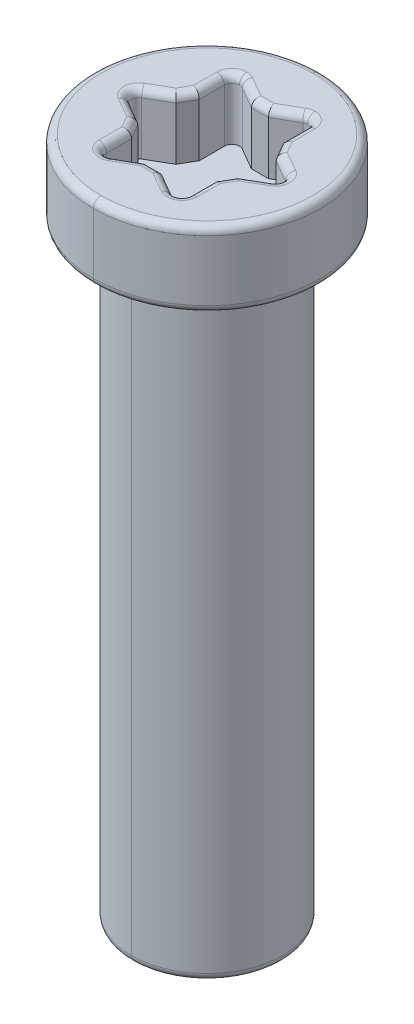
ISO-10303-21;
HEADER;
FILE_DESCRIPTION(('STEP AP214'),'2;1');
FILE_NAME('part.step','',(''),(''),'','','');
FILE_SCHEMA(('AUTOMOTIVE_DESIGN { 1 0 10303 214 1 1 1 1 }'));
ENDSEC;
DATA;
#1=APPLICATION_CONTEXT('core data for automotive mechanical design processes');
#2=APPLICATION_PROTOCOL_DEFINITION('international standard','automotive_design',2000,#1);
#3=PRODUCT_CONTEXT('',#1,'mechanical');
#4=PRODUCT('Part','Part','',(#3));
#5=PRODUCT_RELATED_PRODUCT_CATEGORY('part','',(#4));
#6=PRODUCT_DEFINITION_FORMATION('','',#4);
#7=PRODUCT_DEFINITION_CONTEXT('part definition',#1,'design');
#8=PRODUCT_DEFINITION('design','',#6,#7);
#9=PRODUCT_DEFINITION_SHAPE('','',#8);
#10=(LENGTH_UNIT() NAMED_UNIT(*) SI_UNIT(.MILLI.,.METRE.));
#11=(NAMED_UNIT(*) PLANE_ANGLE_UNIT() SI_UNIT($,.RADIAN.));
#12=(NAMED_UNIT(*) SI_UNIT($,.STERADIAN.) SOLID_ANGLE_UNIT());
#13=UNCERTAINTY_MEASURE_WITH_UNIT(LENGTH_MEASURE(1.E-05),#10,'distance_accuracy_value','');
#14=(GEOMETRIC_REPRESENTATION_CONTEXT(3) GLOBAL_UNCERTAINTY_ASSIGNED_CONTEXT((#13)) GLOBAL_UNIT_ASSIGNED_CONTEXT((#10,
#11,#12)) REPRESENTATION_CONTEXT('',''));
#15=CARTESIAN_POINT('',(0.,0.,0.));
#16=DIRECTION('',(0.,0.,1.));
#17=DIRECTION('',(1.,0.,0.));
#18=AXIS2_PLACEMENT_3D('',#15,#16,#17);
#19=CARTESIAN_POINT('',(0.,8.1,0.));
#20=DIRECTION('',(0.,1.,0.));
#21=DIRECTION('',(0.,0.,1.));
#22=AXIS2_PLACEMENT_3D('',#19,#20,#21);
#23=TOROIDAL_SURFACE('',#22,1.4,0.1);
#24=CARTESIAN_POINT('',(0.,8.1,-1.4));
#25=DIRECTION('',(1.,0.,0.));
#26=DIRECTION('',(0.,0.,-1.));
#27=AXIS2_PLACEMENT_3D('',#24,#25,#26);
#28=CIRCLE('',#27,0.1);
#29=CARTESIAN_POINT('',(0.,8.,-1.4));
#30=VERTEX_POINT('',#29);
#31=CARTESIAN_POINT('',(0.,8.1,-1.5));
#32=VERTEX_POINT('',#31);
#33=EDGE_CURVE('E480',#30,#32,#28,.T.);
#34=ORIENTED_EDGE('',*,*,#33,.F.);
#35=CARTESIAN_POINT('',(0.,8.,0.));
#36=DIRECTION('',(0.,-1.,0.));
#37=DIRECTION('',(0.,0.,1.));
#38=AXIS2_PLACEMENT_3D('',#35,#36,#37);
#39=CIRCLE('',#38,1.4);
#40=CARTESIAN_POINT('',(0.,8.,1.4));
#41=VERTEX_POINT('',#40);
#42=EDGE_CURVE('E709',#41,#30,#39,.T.);
#43=ORIENTED_EDGE('',*,*,#42,.F.);
#44=CARTESIAN_POINT('',(0.,8.1,1.4));
#45=DIRECTION('',(-1.,0.,0.));
#46=DIRECTION('',(0.,0.,1.));
#47=AXIS2_PLACEMENT_3D('',#44,#45,#46);
#48=CIRCLE('',#47,0.1);
#49=CARTESIAN_POINT('',(0.,8.1,1.5));
#50=VERTEX_POINT('',#49);
#51=EDGE_CURVE('E479',#41,#50,#48,.T.);
#52=ORIENTED_EDGE('',*,*,#51,.T.);
#53=CARTESIAN_POINT('',(0.,8.1,0.));
#54=DIRECTION('',(0.,1.,0.));
#55=DIRECTION('',(0.,0.,1.));
#56=AXIS2_PLACEMENT_3D('',#53,#54,#55);
#57=CIRCLE('',#56,1.5);
#58=EDGE_CURVE('E705',#32,#50,#57,.T.);
#59=ORIENTED_EDGE('',*,*,#58,.F.);
#60=EDGE_LOOP('',(#34,#43,#52,#59));
#61=FACE_BOUND('',#60,.T.);
#62=ADVANCED_FACE('F16',(#61),#23,.T.);
#63=CARTESIAN_POINT('',(0.9,8.9,0.));
#64=DIRECTION('',(0.,-1.,0.));
#65=DIRECTION('',(0.,0.,-1.));
#66=AXIS2_PLACEMENT_3D('',#63,#64,#65);
#67=TOROIDAL_SURFACE('',#66,0.2,0.1);
#68=CARTESIAN_POINT('',(1.,8.9,0.173205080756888));
#69=DIRECTION('',(0.86602540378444,0.,-0.5));
#70=DIRECTION('',(-0.5,0.,-0.86602540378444));
#71=AXIS2_PLACEMENT_3D('',#68,#69,#70);
#72=CIRCLE('',#71,0.1);
#73=CARTESIAN_POINT('',(0.95,8.9,0.0866025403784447));
#74=VERTEX_POINT('',#73);
#75=CARTESIAN_POINT('',(1.,9.,0.173205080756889));
#76=VERTEX_POINT('',#75);
#77=EDGE_CURVE('E29',#74,#76,#72,.T.);
#78=ORIENTED_EDGE('',*,*,#77,.T.);
#79=CARTESIAN_POINT('',(0.9,9.,0.));
#80=DIRECTION('',(0.,-1.,0.));
#81=DIRECTION('',(0.,0.,-1.));
#82=AXIS2_PLACEMENT_3D('',#79,#80,#81);
#83=CIRCLE('',#82,0.2);
#84=CARTESIAN_POINT('',(1.,9.,-0.173205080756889));
#85=VERTEX_POINT('',#84);
#86=EDGE_CURVE('E474',#85,#76,#83,.T.);
#87=ORIENTED_EDGE('',*,*,#86,.F.);
#88=CARTESIAN_POINT('',(1.,8.9,-0.173205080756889));
#89=DIRECTION('',(0.866025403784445,0.,0.499999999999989));
#90=DIRECTION('',(0.499999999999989,0.,-0.866025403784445));
#91=AXIS2_PLACEMENT_3D('',#88,#89,#90);
#92=CIRCLE('',#91,0.1);
#93=CARTESIAN_POINT('',(0.95,8.9,-0.0866025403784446));
#94=VERTEX_POINT('',#93);
#95=EDGE_CURVE('E10',#85,#94,#92,.T.);
#96=ORIENTED_EDGE('',*,*,#95,.T.);
#97=CARTESIAN_POINT('',(0.9,8.9,0.));
#98=DIRECTION('',(0.,1.,0.));
#99=DIRECTION('',(0.,0.,-1.));
#100=AXIS2_PLACEMENT_3D('',#97,#98,#99);
#101=CIRCLE('',#100,0.1);
#102=EDGE_CURVE('E756',#74,#94,#101,.T.);
#103=ORIENTED_EDGE('',*,*,#102,.F.);
#104=EDGE_LOOP('',(#78,#87,#96,#103));
#105=FACE_BOUND('',#104,.T.);
#106=ADVANCED_FACE('F1114',(#105),#67,.T.);
#107=CARTESIAN_POINT('',(1.,8.9,-0.173205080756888));
#108=DIRECTION('',(-0.86602540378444,0.,-0.5));
#109=DIRECTION('',(-0.5,0.,0.86602540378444));
#110=AXIS2_PLACEMENT_3D('',#107,#108,#109);
#111=CYLINDRICAL_SURFACE('',#110,0.1);
#112=CARTESIAN_POINT('',(0.735640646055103,9.,-0.325833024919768));
#113=CARTESIAN_POINT('',(0.692758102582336,9.00000000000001,-0.282950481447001));
#114=CARTESIAN_POINT('',(0.662435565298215,8.95857864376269,-0.252627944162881));
#115=CARTESIAN_POINT('',(0.662435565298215,8.9,-0.25262794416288));
#116=(BOUNDED_CURVE() B_SPLINE_CURVE(3,(#112,#113,#114,#115),.UNSPECIFIED.,.F.,
.F.) B_SPLINE_CURVE_WITH_KNOTS((4,4),(1.5707963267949,3.1415926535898),
.UNSPECIFIED.) CURVE() GEOMETRIC_REPRESENTATION_ITEM() RATIONAL_B_SPLINE_CURVE((1.,
0.804737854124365,0.804737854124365,1.)) REPRESENTATION_ITEM(''));
#117=CARTESIAN_POINT('',(0.735640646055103,9.,-0.325833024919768));
#118=VERTEX_POINT('',#117);
#119=CARTESIAN_POINT('',(0.662435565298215,8.9,-0.25262794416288));
#120=VERTEX_POINT('',#119);
#121=EDGE_CURVE('E489',#118,#120,#116,.T.);
#122=ORIENTED_EDGE('',*,*,#121,.T.);
#123=DIRECTION('',(-0.86602540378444,0.,-0.5));
#124=VECTOR('',#123,1.);
#125=CARTESIAN_POINT('',(0.95,8.9,-0.0866025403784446));
#126=LINE('',#125,#124);
#127=EDGE_CURVE('E526',#94,#120,#126,.T.);
#128=ORIENTED_EDGE('',*,*,#127,.F.);
#129=ORIENTED_EDGE('',*,*,#95,.F.);
#130=DIRECTION('',(0.86602540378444,0.,0.5));
#131=VECTOR('',#130,1.);
#132=CARTESIAN_POINT('',(-0.32451905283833,9.,-0.93791651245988));
#133=LINE('',#132,#131);
#134=EDGE_CURVE('E608',#118,#85,#133,.T.);
#135=ORIENTED_EDGE('',*,*,#134,.F.);
#136=EDGE_LOOP('',(#122,#128,#129,#135));
#137=FACE_BOUND('',#136,.T.);
#138=ADVANCED_FACE('F1118',(#137),#111,.T.);
#139=CARTESIAN_POINT('',(0.712435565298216,8.9,0.339230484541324));
#140=DIRECTION('',(0.86602540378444,0.,-0.5));
#141=DIRECTION('',(-0.5,0.,-0.86602540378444));
#142=AXIS2_PLACEMENT_3D('',#139,#140,#141);
#143=CYLINDRICAL_SURFACE('',#142,0.1);
#144=CARTESIAN_POINT('',(0.662435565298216,8.9,0.25262794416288));
#145=CARTESIAN_POINT('',(0.662435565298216,8.95857864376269,0.25262794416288));
#146=CARTESIAN_POINT('',(0.692758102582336,9.00000000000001,0.282950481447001));
#147=CARTESIAN_POINT('',(0.735640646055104,9.,0.325833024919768));
#148=(BOUNDED_CURVE() B_SPLINE_CURVE(3,(#144,#145,#146,#147),.UNSPECIFIED.,.F.,
.F.) B_SPLINE_CURVE_WITH_KNOTS((4,4),(3.1415926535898,4.71238898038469),
.UNSPECIFIED.) CURVE() GEOMETRIC_REPRESENTATION_ITEM() RATIONAL_B_SPLINE_CURVE((1.,
0.804737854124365,0.804737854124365,1.)) REPRESENTATION_ITEM(''));
#149=CARTESIAN_POINT('',(0.662435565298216,8.9,0.25262794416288));
#150=VERTEX_POINT('',#149);
#151=CARTESIAN_POINT('',(0.735640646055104,9.,0.325833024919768));
#152=VERTEX_POINT('',#151);
#153=EDGE_CURVE('E631',#150,#152,#148,.T.);
#154=ORIENTED_EDGE('',*,*,#153,.T.);
#155=DIRECTION('',(-0.86602540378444,0.,0.5));
#156=VECTOR('',#155,1.);
#157=CARTESIAN_POINT('',(0.974519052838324,9.,0.187916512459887));
#158=LINE('',#157,#156);
#159=EDGE_CURVE('E465',#76,#152,#158,.T.);
#160=ORIENTED_EDGE('',*,*,#159,.F.);
#161=ORIENTED_EDGE('',*,*,#77,.F.);
#162=DIRECTION('',(0.86602540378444,0.,-0.5));
#163=VECTOR('',#162,1.);
#164=CARTESIAN_POINT('',(0.662435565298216,8.9,0.25262794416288));
#165=LINE('',#164,#163);
#166=EDGE_CURVE('E470',#150,#74,#165,.T.);
#167=ORIENTED_EDGE('',*,*,#166,.F.);
#168=EDGE_LOOP('',(#154,#160,#161,#167));
#169=FACE_BOUND('',#168,.T.);
#170=ADVANCED_FACE('F1572',(#169),#143,.T.);
#171=CARTESIAN_POINT('',(0.749038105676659,8.9,-0.302627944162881));
#172=DIRECTION('',(-0.5,0.,-0.866025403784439));
#173=DIRECTION('',(-0.866025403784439,0.,0.5));
#174=AXIS2_PLACEMENT_3D('',#171,#172,#173);
#175=CYLINDRICAL_SURFACE('',#174,0.1);
#176=CARTESIAN_POINT('',(0.65,9.,-0.474166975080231));
#177=CARTESIAN_POINT('',(0.591421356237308,9.00000000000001,-0.458470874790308));
#178=CARTESIAN_POINT('',(0.549999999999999,8.95857864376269,-0.447372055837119));
#179=CARTESIAN_POINT('',(0.55,8.9,-0.447372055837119));
#180=(BOUNDED_CURVE() B_SPLINE_CURVE(3,(#176,#177,#178,#179),.UNSPECIFIED.,.F.,
.F.) B_SPLINE_CURVE_WITH_KNOTS((4,4),(1.5707963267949,3.1415926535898),
.UNSPECIFIED.) CURVE() GEOMETRIC_REPRESENTATION_ITEM() RATIONAL_B_SPLINE_CURVE((1.,
0.804737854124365,0.804737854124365,1.)) REPRESENTATION_ITEM(''));
#181=CARTESIAN_POINT('',(0.65,9.,-0.474166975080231));
#182=VERTEX_POINT('',#181);
#183=CARTESIAN_POINT('',(0.55,8.9,-0.447372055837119));
#184=VERTEX_POINT('',#183);
#185=EDGE_CURVE('E670',#182,#184,#180,.T.);
#186=ORIENTED_EDGE('',*,*,#185,.T.);
#187=DIRECTION('',(-0.5,0.,-0.866025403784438));
#188=VECTOR('',#187,1.);
#189=CARTESIAN_POINT('',(0.662435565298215,8.9,-0.25262794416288));
#190=LINE('',#189,#188);
#191=EDGE_CURVE('E561',#120,#184,#190,.T.);
#192=ORIENTED_EDGE('',*,*,#191,.F.);
#193=ORIENTED_EDGE('',*,*,#121,.F.);
#194=DIRECTION('',(0.5,0.,0.866025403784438));
#195=VECTOR('',#194,1.);
#196=CARTESIAN_POINT('',(0.0433012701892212,9.,-1.525));
#197=LINE('',#196,#195);
#198=EDGE_CURVE('E819',#182,#118,#197,.T.);
#199=ORIENTED_EDGE('',*,*,#198,.F.);
#200=EDGE_LOOP('',(#186,#192,#193,#199));
#201=FACE_BOUND('',#200,.T.);
#202=ADVANCED_FACE('F1576',(#201),#175,.T.);
#203=CARTESIAN_POINT('',(0.636602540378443,8.9,0.49737205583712));
#204=DIRECTION('',(0.5,0.,-0.866025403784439));
#205=DIRECTION('',(-0.866025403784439,0.,-0.5));
#206=AXIS2_PLACEMENT_3D('',#203,#204,#205);
#207=CYLINDRICAL_SURFACE('',#206,0.1);
#208=CARTESIAN_POINT('',(0.55,8.9,0.447372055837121));
#209=CARTESIAN_POINT('',(0.549999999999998,8.95857864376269,0.44737205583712));
#210=CARTESIAN_POINT('',(0.591421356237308,9.00000000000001,0.458470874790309));
#211=CARTESIAN_POINT('',(0.65,9.,0.474166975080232));
#212=(BOUNDED_CURVE() B_SPLINE_CURVE(3,(#208,#209,#210,#211),.UNSPECIFIED.,.F.,
.F.) B_SPLINE_CURVE_WITH_KNOTS((4,4),(3.1415926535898,4.71238898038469),
.UNSPECIFIED.) CURVE() GEOMETRIC_REPRESENTATION_ITEM() RATIONAL_B_SPLINE_CURVE((1.,
0.804737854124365,0.804737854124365,1.)) REPRESENTATION_ITEM(''));
#213=CARTESIAN_POINT('',(0.55,8.9,0.447372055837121));
#214=VERTEX_POINT('',#213);
#215=CARTESIAN_POINT('',(0.65,9.,0.474166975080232));
#216=VERTEX_POINT('',#215);
#217=EDGE_CURVE('E679',#214,#216,#212,.T.);
#218=ORIENTED_EDGE('',*,*,#217,.T.);
#219=DIRECTION('',(-0.5,0.,0.866025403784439));
#220=VECTOR('',#219,1.);
#221=CARTESIAN_POINT('',(1.34233937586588,9.,-0.725));
#222=LINE('',#221,#220);
#223=EDGE_CURVE('E460',#152,#216,#222,.T.);
#224=ORIENTED_EDGE('',*,*,#223,.F.);
#225=ORIENTED_EDGE('',*,*,#153,.F.);
#226=DIRECTION('',(0.5,0.,-0.866025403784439));
#227=VECTOR('',#226,1.);
#228=CARTESIAN_POINT('',(0.55,8.9,0.447372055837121));
#229=LINE('',#228,#227);
#230=EDGE_CURVE('E490',#214,#150,#229,.T.);
#231=ORIENTED_EDGE('',*,*,#230,.F.);
#232=EDGE_LOOP('',(#218,#224,#225,#231));
#233=FACE_BOUND('',#232,.T.);
#234=ADVANCED_FACE('F1100',(#233),#207,.T.);
#235=CARTESIAN_POINT('',(0.65,8.9,-0.447372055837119));
#236=DIRECTION('',(0.,0.,-1.));
#237=DIRECTION('',(-1.,0.,0.));
#238=AXIS2_PLACEMENT_3D('',#235,#236,#237);
#239=CYLINDRICAL_SURFACE('',#238,0.1);
#240=CARTESIAN_POINT('',(0.650000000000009,8.9,-0.779422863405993));
#241=DIRECTION('',(0.,0.,1.));
#242=DIRECTION('',(1.,0.,0.));
#243=AXIS2_PLACEMENT_3D('',#240,#241,#242);
#244=CIRCLE('',#243,0.1);
#245=CARTESIAN_POINT('',(0.650000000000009,9.,-0.779422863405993));
#246=VERTEX_POINT('',#245);
#247=CARTESIAN_POINT('',(0.55,8.9,-0.779422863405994));
#248=VERTEX_POINT('',#247);
#249=EDGE_CURVE('E690',#246,#248,#244,.T.);
#250=ORIENTED_EDGE('',*,*,#249,.T.);
#251=DIRECTION('',(0.,0.,-1.));
#252=VECTOR('',#251,1.);
#253=CARTESIAN_POINT('',(0.55,8.9,-0.447372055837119));
#254=LINE('',#253,#252);
#255=EDGE_CURVE('E626',#184,#248,#254,.T.);
#256=ORIENTED_EDGE('',*,*,#255,.F.);
#257=ORIENTED_EDGE('',*,*,#185,.F.);
#258=DIRECTION('',(0.,0.,1.));
#259=VECTOR('',#258,1.);
#260=CARTESIAN_POINT('',(0.65,9.,-1.5));
#261=LINE('',#260,#259);
#262=EDGE_CURVE('E782',#246,#182,#261,.T.);
#263=ORIENTED_EDGE('',*,*,#262,.F.);
#264=EDGE_LOOP('',(#250,#256,#257,#263));
#265=FACE_BOUND('',#264,.T.);
#266=ADVANCED_FACE('F1667',(#265),#239,.T.);
#267=CARTESIAN_POINT('',(0.65,8.9,0.779422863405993));
#268=DIRECTION('',(0.,0.,-1.));
#269=DIRECTION('',(-1.,0.,0.));
#270=AXIS2_PLACEMENT_3D('',#267,#268,#269);
#271=CYLINDRICAL_SURFACE('',#270,0.1);
#272=CARTESIAN_POINT('',(0.65,8.9,0.779422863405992));
#273=DIRECTION('',(0.,0.,-1.));
#274=DIRECTION('',(-1.,0.,0.));
#275=AXIS2_PLACEMENT_3D('',#272,#273,#274);
#276=CIRCLE('',#275,0.1);
#277=CARTESIAN_POINT('',(0.55,8.9,0.779422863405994));
#278=VERTEX_POINT('',#277);
#279=CARTESIAN_POINT('',(0.65,9.,0.779422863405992));
#280=VERTEX_POINT('',#279);
#281=EDGE_CURVE('E728',#278,#280,#276,.T.);
#282=ORIENTED_EDGE('',*,*,#281,.T.);
#283=DIRECTION('',(0.,0.,1.));
#284=VECTOR('',#283,1.);
#285=CARTESIAN_POINT('',(0.649999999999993,9.,-1.5));
#286=LINE('',#285,#284);
#287=EDGE_CURVE('E464',#216,#280,#286,.T.);
#288=ORIENTED_EDGE('',*,*,#287,.F.);
#289=ORIENTED_EDGE('',*,*,#217,.F.);
#290=DIRECTION('',(0.,0.,-1.));
#291=VECTOR('',#290,1.);
#292=CARTESIAN_POINT('',(0.55,8.9,0.779422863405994));
#293=LINE('',#292,#291);
#294=EDGE_CURVE('E885',#278,#214,#293,.T.);
#295=ORIENTED_EDGE('',*,*,#294,.F.);
#296=EDGE_LOOP('',(#282,#288,#289,#295));
#297=FACE_BOUND('',#296,.T.);
#298=ADVANCED_FACE('F1098',(#297),#271,.T.);
#299=CARTESIAN_POINT('',(0.450000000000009,8.9,-0.779422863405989));
#300=DIRECTION('',(0.,-1.,0.));
#301=DIRECTION('',(0.,0.,-1.));
#302=AXIS2_PLACEMENT_3D('',#299,#300,#301);
#303=TOROIDAL_SURFACE('',#302,0.2,0.1);
#304=CARTESIAN_POINT('',(0.450000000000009,8.9,-0.979422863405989));
#305=DIRECTION('',(-1.,0.,0.));
#306=DIRECTION('',(0.,0.,1.));
#307=AXIS2_PLACEMENT_3D('',#304,#305,#306);
#308=CIRCLE('',#307,0.1);
#309=CARTESIAN_POINT('',(0.450000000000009,8.9,-0.879422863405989));
#310=VERTEX_POINT('',#309);
#311=CARTESIAN_POINT('',(0.450000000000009,9.,-0.979422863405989));
#312=VERTEX_POINT('',#311);
#313=EDGE_CURVE('E604',#310,#312,#308,.T.);
#314=ORIENTED_EDGE('',*,*,#313,.F.);
#315=CARTESIAN_POINT('',(0.450000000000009,8.9,-0.779422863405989));
#316=DIRECTION('',(0.,1.,0.));
#317=DIRECTION('',(0.,0.,-1.));
#318=AXIS2_PLACEMENT_3D('',#315,#316,#317);
#319=CIRCLE('',#318,0.1);
#320=EDGE_CURVE('E501',#248,#310,#319,.T.);
#321=ORIENTED_EDGE('',*,*,#320,.F.);
#322=ORIENTED_EDGE('',*,*,#249,.F.);
#323=CARTESIAN_POINT('',(0.450000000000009,9.,-0.779422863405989));
#324=DIRECTION('',(0.,-1.,0.));
#325=DIRECTION('',(0.,0.,-1.));
#326=AXIS2_PLACEMENT_3D('',#323,#324,#325);
#327=CIRCLE('',#326,0.2);
#328=EDGE_CURVE('E778',#312,#246,#327,.T.);
#329=ORIENTED_EDGE('',*,*,#328,.F.);
#330=EDGE_LOOP('',(#314,#321,#322,#329));
#331=FACE_BOUND('',#330,.T.);
#332=ADVANCED_FACE('F1666',(#331),#303,.T.);
#333=CARTESIAN_POINT('',(0.45,8.9,0.779422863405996));
#334=DIRECTION('',(0.,-1.,0.));
#335=DIRECTION('',(0.,0.,-1.));
#336=AXIS2_PLACEMENT_3D('',#333,#334,#335);
#337=TOROIDAL_SURFACE('',#336,0.2,0.1);
#338=CARTESIAN_POINT('',(0.35,8.9,0.952627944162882));
#339=DIRECTION('',(0.86602540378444,0.,0.5));
#340=DIRECTION('',(0.5,0.,-0.86602540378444));
#341=AXIS2_PLACEMENT_3D('',#338,#339,#340);
#342=CIRCLE('',#341,0.1);
#343=CARTESIAN_POINT('',(0.4,8.9,0.866025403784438));
#344=VERTEX_POINT('',#343);
#345=CARTESIAN_POINT('',(0.35,9.,0.952627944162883));
#346=VERTEX_POINT('',#345);
#347=EDGE_CURVE('E731',#344,#346,#342,.T.);
#348=ORIENTED_EDGE('',*,*,#347,.T.);
#349=CARTESIAN_POINT('',(0.45,9.,0.779422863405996));
#350=DIRECTION('',(0.,-1.,0.));
#351=DIRECTION('',(0.,0.,-1.));
#352=AXIS2_PLACEMENT_3D('',#349,#350,#351);
#353=CIRCLE('',#352,0.2);
#354=EDGE_CURVE('E739',#280,#346,#353,.T.);
#355=ORIENTED_EDGE('',*,*,#354,.F.);
#356=ORIENTED_EDGE('',*,*,#281,.F.);
#357=CARTESIAN_POINT('',(0.45,8.9,0.779422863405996));
#358=DIRECTION('',(0.,1.,0.));
#359=DIRECTION('',(0.,0.,-1.));
#360=AXIS2_PLACEMENT_3D('',#357,#358,#359);
#361=CIRCLE('',#360,0.1);
#362=CARTESIAN_POINT('',(0.45,8.9,0.879422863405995));
#363=VERTEX_POINT('',#362);
#364=EDGE_CURVE('E510',#363,#278,#361,.T.);
#365=ORIENTED_EDGE('',*,*,#364,.F.);
#366=CARTESIAN_POINT('',(0.45,8.9,0.779422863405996));
#367=DIRECTION('',(0.,1.,0.));
#368=DIRECTION('',(0.,0.,-1.));
#369=AXIS2_PLACEMENT_3D('',#366,#367,#368);
#370=CIRCLE('',#369,0.1);
#371=EDGE_CURVE('E609',#344,#363,#370,.T.);
#372=ORIENTED_EDGE('',*,*,#371,.F.);
#373=EDGE_LOOP('',(#348,#355,#356,#365,#372));
#374=FACE_BOUND('',#373,.T.);
#375=ADVANCED_FACE('F1077',(#374),#337,.T.);
#376=CARTESIAN_POINT('',(0.35,8.9,-0.952627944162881));
#377=DIRECTION('',(-0.866025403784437,0.,0.5));
#378=DIRECTION('',(0.5,0.,0.866025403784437));
#379=AXIS2_PLACEMENT_3D('',#376,#377,#378);
#380=CYLINDRICAL_SURFACE('',#379,0.1);
#381=CARTESIAN_POINT('',(0.085640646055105,9.,-0.8));
#382=CARTESIAN_POINT('',(0.101336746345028,8.99999999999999,-0.74142135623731));
#383=CARTESIAN_POINT('',(0.112435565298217,8.95857864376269,-0.699999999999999));
#384=CARTESIAN_POINT('',(0.112435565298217,8.9,-0.7));
#385=(BOUNDED_CURVE() B_SPLINE_CURVE(3,(#381,#382,#383,#384),.UNSPECIFIED.,.F.,
.F.) B_SPLINE_CURVE_WITH_KNOTS((4,4),(1.5707963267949,3.1415926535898),
.UNSPECIFIED.) CURVE() GEOMETRIC_REPRESENTATION_ITEM() RATIONAL_B_SPLINE_CURVE((1.,
0.804737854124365,0.804737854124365,1.)) REPRESENTATION_ITEM(''));
#386=CARTESIAN_POINT('',(0.085640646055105,9.,-0.8));
#387=VERTEX_POINT('',#386);
#388=CARTESIAN_POINT('',(0.112435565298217,8.9,-0.7));
#389=VERTEX_POINT('',#388);
#390=EDGE_CURVE('E453',#387,#389,#385,.T.);
#391=ORIENTED_EDGE('',*,*,#390,.T.);
#392=DIRECTION('',(-0.866025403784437,0.,0.5));
#393=VECTOR('',#392,1.);
#394=CARTESIAN_POINT('',(0.4,8.9,-0.866025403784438));
#395=LINE('',#394,#393);
#396=CARTESIAN_POINT('',(0.4,8.9,-0.86602540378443));
#397=VERTEX_POINT('',#396);
#398=EDGE_CURVE('E799',#397,#389,#395,.T.);
#399=ORIENTED_EDGE('',*,*,#398,.F.);
#400=CARTESIAN_POINT('',(0.349999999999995,8.9,-0.952627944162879));
#401=DIRECTION('',(0.866025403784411,0.,-0.500000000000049));
#402=DIRECTION('',(-0.500000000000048,0.,-0.866025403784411));
#403=AXIS2_PLACEMENT_3D('',#400,#401,#402);
#404=CIRCLE('',#403,0.1);
#405=CARTESIAN_POINT('',(0.349999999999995,9.,-0.952627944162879));
#406=VERTEX_POINT('',#405);
#407=EDGE_CURVE('E520',#406,#397,#404,.T.);
#408=ORIENTED_EDGE('',*,*,#407,.F.);
#409=DIRECTION('',(0.866025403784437,0.,-0.5));
#410=VECTOR('',#409,1.);
#411=CARTESIAN_POINT('',(0.324519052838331,9.,-0.937916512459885));
#412=LINE('',#411,#410);
#413=EDGE_CURVE('E783',#387,#406,#412,.T.);
#414=ORIENTED_EDGE('',*,*,#413,.F.);
#415=EDGE_LOOP('',(#391,#399,#408,#414));
#416=FACE_BOUND('',#415,.T.);
#417=ADVANCED_FACE('F1149',(#416),#380,.T.);
#418=CARTESIAN_POINT('',(0.062435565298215,8.9,0.786602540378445));
#419=DIRECTION('',(0.86602540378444,0.,0.5));
#420=DIRECTION('',(0.5,0.,-0.86602540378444));
#421=AXIS2_PLACEMENT_3D('',#418,#419,#420);
#422=CYLINDRICAL_SURFACE('',#421,0.1);
#423=CARTESIAN_POINT('',(0.112435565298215,8.9,0.7));
#424=CARTESIAN_POINT('',(0.112435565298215,8.95857864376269,0.700000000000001));
#425=CARTESIAN_POINT('',(0.101336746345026,9.00000000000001,0.741421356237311));
#426=CARTESIAN_POINT('',(0.0856406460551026,9.,0.8));
#427=(BOUNDED_CURVE() B_SPLINE_CURVE(3,(#423,#424,#425,#426),.UNSPECIFIED.,.F.,
.F.) B_SPLINE_CURVE_WITH_KNOTS((4,4),(3.1415926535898,4.71238898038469),
.UNSPECIFIED.) CURVE() GEOMETRIC_REPRESENTATION_ITEM() RATIONAL_B_SPLINE_CURVE((1.,
0.804737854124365,0.804737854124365,1.)) REPRESENTATION_ITEM(''));
#428=CARTESIAN_POINT('',(0.112435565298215,8.9,0.7));
#429=VERTEX_POINT('',#428);
#430=CARTESIAN_POINT('',(0.0856406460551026,9.,0.8));
#431=VERTEX_POINT('',#430);
#432=EDGE_CURVE('E449',#429,#431,#427,.T.);
#433=ORIENTED_EDGE('',*,*,#432,.T.);
#434=DIRECTION('',(-0.86602540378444,0.,-0.5));
#435=VECTOR('',#434,1.);
#436=CARTESIAN_POINT('',(-0.974519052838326,9.,0.18791651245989));
#437=LINE('',#436,#435);
#438=EDGE_CURVE('E443',#346,#431,#437,.T.);
#439=ORIENTED_EDGE('',*,*,#438,.F.);
#440=ORIENTED_EDGE('',*,*,#347,.F.);
#441=DIRECTION('',(0.86602540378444,0.,0.5));
#442=VECTOR('',#441,1.);
#443=CARTESIAN_POINT('',(0.112435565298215,8.9,0.7));
#444=LINE('',#443,#442);
#445=EDGE_CURVE('E752',#429,#344,#444,.T.);
#446=ORIENTED_EDGE('',*,*,#445,.F.);
#447=EDGE_LOOP('',(#433,#439,#440,#446));
#448=FACE_BOUND('',#447,.T.);
#449=ADVANCED_FACE('F1072',(#448),#422,.T.);
#450=CARTESIAN_POINT('',(0.112435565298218,8.9,-0.8));
#451=DIRECTION('',(-1.,0.,0.));
#452=DIRECTION('',(0.,0.,1.));
#453=AXIS2_PLACEMENT_3D('',#450,#451,#452);
#454=CYLINDRICAL_SURFACE('',#453,0.1);
#455=CARTESIAN_POINT('',(-0.0856406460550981,9.,-0.8));
#456=CARTESIAN_POINT('',(-0.101336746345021,9.00000000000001,-0.741421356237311));
#457=CARTESIAN_POINT('',(-0.11243556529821,8.95857864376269,-0.700000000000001));
#458=CARTESIAN_POINT('',(-0.11243556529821,8.9,-0.7));
#459=(BOUNDED_CURVE() B_SPLINE_CURVE(3,(#455,#456,#457,#458),.UNSPECIFIED.,.F.,
.F.) B_SPLINE_CURVE_WITH_KNOTS((4,4),(1.5707963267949,3.1415926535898),
.UNSPECIFIED.) CURVE() GEOMETRIC_REPRESENTATION_ITEM() RATIONAL_B_SPLINE_CURVE((1.,
0.804737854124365,0.804737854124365,1.)) REPRESENTATION_ITEM(''));
#460=CARTESIAN_POINT('',(-0.0856406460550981,9.,-0.8));
#461=VERTEX_POINT('',#460);
#462=CARTESIAN_POINT('',(-0.11243556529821,8.9,-0.7));
#463=VERTEX_POINT('',#462);
#464=EDGE_CURVE('E454',#461,#463,#459,.T.);
#465=ORIENTED_EDGE('',*,*,#464,.T.);
#466=DIRECTION('',(-1.,0.,0.));
#467=VECTOR('',#466,1.);
#468=CARTESIAN_POINT('',(0.112435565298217,8.9,-0.7));
#469=LINE('',#468,#467);
#470=EDGE_CURVE('E546',#389,#463,#469,.T.);
#471=ORIENTED_EDGE('',*,*,#470,.F.);
#472=ORIENTED_EDGE('',*,*,#390,.F.);
#473=DIRECTION('',(1.,0.,0.));
#474=VECTOR('',#473,1.);
#475=CARTESIAN_POINT('',(0.,9.,-0.8));
#476=LINE('',#475,#474);
#477=EDGE_CURVE('E654',#461,#387,#476,.T.);
#478=ORIENTED_EDGE('',*,*,#477,.F.);
#479=EDGE_LOOP('',(#465,#471,#472,#478));
#480=FACE_BOUND('',#479,.T.);
#481=ADVANCED_FACE('F1152',(#480),#454,.T.);
#482=CARTESIAN_POINT('',(-0.112435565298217,8.9,0.8));
#483=DIRECTION('',(1.,0.,0.));
#484=DIRECTION('',(0.,0.,-1.));
#485=AXIS2_PLACEMENT_3D('',#482,#483,#484);
#486=CYLINDRICAL_SURFACE('',#485,0.1);
#487=CARTESIAN_POINT('',(-0.112435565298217,8.9,0.7));
#488=CARTESIAN_POINT('',(-0.112435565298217,8.95857864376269,0.700000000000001));
#489=CARTESIAN_POINT('',(-0.101336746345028,9.00000000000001,0.74142135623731));
#490=CARTESIAN_POINT('',(-0.0856406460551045,9.,0.8));
#491=(BOUNDED_CURVE() B_SPLINE_CURVE(3,(#487,#488,#489,#490),.UNSPECIFIED.,.F.,
.F.) B_SPLINE_CURVE_WITH_KNOTS((4,4),(3.1415926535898,4.71238898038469),
.UNSPECIFIED.) CURVE() GEOMETRIC_REPRESENTATION_ITEM() RATIONAL_B_SPLINE_CURVE((1.,
0.804737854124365,0.804737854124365,1.)) REPRESENTATION_ITEM(''));
#492=CARTESIAN_POINT('',(-0.112435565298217,8.9,0.7));
#493=VERTEX_POINT('',#492);
#494=CARTESIAN_POINT('',(-0.0856406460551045,9.,0.8));
#495=VERTEX_POINT('',#494);
#496=EDGE_CURVE('E20',#493,#495,#491,.T.);
#497=ORIENTED_EDGE('',*,*,#496,.T.);
#498=DIRECTION('',(-1.,0.,0.));
#499=VECTOR('',#498,1.);
#500=CARTESIAN_POINT('',(0.,9.,0.8));
#501=LINE('',#500,#499);
#502=EDGE_CURVE('E435',#431,#495,#501,.T.);
#503=ORIENTED_EDGE('',*,*,#502,.F.);
#504=ORIENTED_EDGE('',*,*,#432,.F.);
#505=DIRECTION('',(1.,0.,0.));
#506=VECTOR('',#505,1.);
#507=CARTESIAN_POINT('',(-0.112435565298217,8.9,0.7));
#508=LINE('',#507,#506);
#509=EDGE_CURVE('E820',#493,#429,#508,.T.);
#510=ORIENTED_EDGE('',*,*,#509,.F.);
#511=EDGE_LOOP('',(#497,#503,#504,#510));
#512=FACE_BOUND('',#511,.T.);
#513=ADVANCED_FACE('F1546',(#512),#486,.T.);
#514=CARTESIAN_POINT('',(-0.0624355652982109,8.9,-0.786602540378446));
#515=DIRECTION('',(-0.866025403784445,0.,-0.499999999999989));
#516=DIRECTION('',(-0.499999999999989,0.,0.866025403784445));
#517=AXIS2_PLACEMENT_3D('',#514,#515,#516);
#518=CYLINDRICAL_SURFACE('',#517,0.1);
#519=CARTESIAN_POINT('',(-0.35,8.9,-0.952627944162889));
#520=DIRECTION('',(0.866025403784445,0.,0.49999999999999));
#521=DIRECTION('',(0.499999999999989,0.,-0.866025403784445));
#522=AXIS2_PLACEMENT_3D('',#519,#520,#521);
#523=CIRCLE('',#522,0.1);
#524=CARTESIAN_POINT('',(-0.35,9.,-0.952627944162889));
#525=VERTEX_POINT('',#524);
#526=CARTESIAN_POINT('',(-0.4,8.9,-0.866025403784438));
#527=VERTEX_POINT('',#526);
#528=EDGE_CURVE('E416',#525,#527,#523,.T.);
#529=ORIENTED_EDGE('',*,*,#528,.T.);
#530=DIRECTION('',(-0.866025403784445,0.,-0.49999999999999));
#531=VECTOR('',#530,1.);
#532=CARTESIAN_POINT('',(-0.11243556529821,8.9,-0.7));
#533=LINE('',#532,#531);
#534=EDGE_CURVE('E500',#463,#527,#533,.T.);
#535=ORIENTED_EDGE('',*,*,#534,.F.);
#536=ORIENTED_EDGE('',*,*,#464,.F.);
#537=DIRECTION('',(0.866025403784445,0.,0.49999999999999));
#538=VECTOR('',#537,1.);
#539=CARTESIAN_POINT('',(-0.324519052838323,9.,-0.937916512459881));
#540=LINE('',#539,#538);
#541=EDGE_CURVE('E650',#525,#461,#540,.T.);
#542=ORIENTED_EDGE('',*,*,#541,.F.);
#543=EDGE_LOOP('',(#529,#535,#536,#542));
#544=FACE_BOUND('',#543,.T.);
#545=ADVANCED_FACE('F18',(#544),#518,.T.);
#546=CARTESIAN_POINT('',(-0.35,8.9,0.952627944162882));
#547=DIRECTION('',(0.866025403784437,0.,-0.5));
#548=DIRECTION('',(-0.5,0.,-0.866025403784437));
#549=AXIS2_PLACEMENT_3D('',#546,#547,#548);
#550=CYLINDRICAL_SURFACE('',#549,0.1);
#551=CARTESIAN_POINT('',(-0.35,8.9,0.952627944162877));
#552=DIRECTION('',(0.866025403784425,0.,-0.500000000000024));
#553=DIRECTION('',(-0.500000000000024,0.,-0.866025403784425));
#554=AXIS2_PLACEMENT_3D('',#551,#552,#553);
#555=CIRCLE('',#554,0.1);
#556=CARTESIAN_POINT('',(-0.4,8.9,0.866025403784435));
#557=VERTEX_POINT('',#556);
#558=CARTESIAN_POINT('',(-0.35,9.,0.95262794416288));
#559=VERTEX_POINT('',#558);
#560=EDGE_CURVE('E404',#557,#559,#555,.T.);
#561=ORIENTED_EDGE('',*,*,#560,.T.);
#562=DIRECTION('',(-0.866025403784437,0.,0.5));
#563=VECTOR('',#562,1.);
#564=CARTESIAN_POINT('',(0.974519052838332,9.,0.187916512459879));
#565=LINE('',#564,#563);
#566=EDGE_CURVE('E408',#495,#559,#565,.T.);
#567=ORIENTED_EDGE('',*,*,#566,.F.);
#568=ORIENTED_EDGE('',*,*,#496,.F.);
#569=DIRECTION('',(0.866025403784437,0.,-0.5));
#570=VECTOR('',#569,1.);
#571=CARTESIAN_POINT('',(-0.4,8.9,0.866025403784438));
#572=LINE('',#571,#570);
#573=EDGE_CURVE('E411',#557,#493,#572,.T.);
#574=ORIENTED_EDGE('',*,*,#573,.F.);
#575=EDGE_LOOP('',(#561,#567,#568,#574));
#576=FACE_BOUND('',#575,.T.);
#577=ADVANCED_FACE('F406',(#576),#550,.T.);
#578=CARTESIAN_POINT('',(-0.449999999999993,8.9,-0.779422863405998));
#579=DIRECTION('',(0.,-1.,0.));
#580=DIRECTION('',(0.,0.,-1.));
#581=AXIS2_PLACEMENT_3D('',#578,#579,#580);
#582=TOROIDAL_SURFACE('',#581,0.2,0.1);
#583=CARTESIAN_POINT('',(-0.449999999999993,8.9,-0.979422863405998));
#584=DIRECTION('',(-1.,0.,0.));
#585=DIRECTION('',(0.,0.,1.));
#586=AXIS2_PLACEMENT_3D('',#583,#584,#585);
#587=CIRCLE('',#586,0.1);
#588=CARTESIAN_POINT('',(-0.449999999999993,8.9,-0.879422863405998));
#589=VERTEX_POINT('',#588);
#590=CARTESIAN_POINT('',(-0.449999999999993,9.,-0.979422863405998));
#591=VERTEX_POINT('',#590);
#592=EDGE_CURVE('E698',#589,#591,#587,.T.);
#593=ORIENTED_EDGE('',*,*,#592,.F.);
#594=CARTESIAN_POINT('',(-0.449999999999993,8.9,-0.779422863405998));
#595=DIRECTION('',(0.,1.,0.));
#596=DIRECTION('',(0.,0.,-1.));
#597=AXIS2_PLACEMENT_3D('',#594,#595,#596);
#598=CIRCLE('',#597,0.1);
#599=EDGE_CURVE('E591',#527,#589,#598,.T.);
#600=ORIENTED_EDGE('',*,*,#599,.F.);
#601=ORIENTED_EDGE('',*,*,#528,.F.);
#602=CARTESIAN_POINT('',(-0.449999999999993,9.,-0.779422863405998));
#603=DIRECTION('',(0.,-1.,0.));
#604=DIRECTION('',(0.,0.,-1.));
#605=AXIS2_PLACEMENT_3D('',#602,#603,#604);
#606=CIRCLE('',#605,0.2);
#607=EDGE_CURVE('E598',#591,#525,#606,.T.);
#608=ORIENTED_EDGE('',*,*,#607,.F.);
#609=EDGE_LOOP('',(#593,#600,#601,#608));
#610=FACE_BOUND('',#609,.T.);
#611=ADVANCED_FACE('F1825',(#610),#582,.T.);
#612=CARTESIAN_POINT('',(-0.45,8.9,0.779422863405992));
#613=DIRECTION('',(0.,-1.,0.));
#614=DIRECTION('',(0.,0.,-1.));
#615=AXIS2_PLACEMENT_3D('',#612,#613,#614);
#616=TOROIDAL_SURFACE('',#615,0.2,0.1);
#617=CARTESIAN_POINT('',(-0.65,8.9,0.779422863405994));
#618=DIRECTION('',(0.,0.,1.));
#619=DIRECTION('',(1.,0.,0.));
#620=AXIS2_PLACEMENT_3D('',#617,#618,#619);
#621=CIRCLE('',#620,0.1);
#622=CARTESIAN_POINT('',(-0.55,8.9,0.779422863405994));
#623=VERTEX_POINT('',#622);
#624=CARTESIAN_POINT('',(-0.65,9.,0.779422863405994));
#625=VERTEX_POINT('',#624);
#626=EDGE_CURVE('E417',#623,#625,#621,.T.);
#627=ORIENTED_EDGE('',*,*,#626,.T.);
#628=CARTESIAN_POINT('',(-0.45,9.,0.779422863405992));
#629=DIRECTION('',(0.,-1.,0.));
#630=DIRECTION('',(0.,0.,-1.));
#631=AXIS2_PLACEMENT_3D('',#628,#629,#630);
#632=CIRCLE('',#631,0.2);
#633=EDGE_CURVE('E420',#559,#625,#632,.T.);
#634=ORIENTED_EDGE('',*,*,#633,.F.);
#635=ORIENTED_EDGE('',*,*,#560,.F.);
#636=CARTESIAN_POINT('',(-0.45,8.9,0.779422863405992));
#637=DIRECTION('',(0.,1.,0.));
#638=DIRECTION('',(0.,0.,-1.));
#639=AXIS2_PLACEMENT_3D('',#636,#637,#638);
#640=CIRCLE('',#639,0.1);
#641=CARTESIAN_POINT('',(-0.45,8.9,0.879422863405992));
#642=VERTEX_POINT('',#641);
#643=EDGE_CURVE('E875',#642,#557,#640,.T.);
#644=ORIENTED_EDGE('',*,*,#643,.F.);
#645=CARTESIAN_POINT('',(-0.45,8.9,0.779422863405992));
#646=DIRECTION('',(0.,1.,0.));
#647=DIRECTION('',(0.,0.,-1.));
#648=AXIS2_PLACEMENT_3D('',#645,#646,#647);
#649=CIRCLE('',#648,0.1);
#650=EDGE_CURVE('E547',#623,#642,#649,.T.);
#651=ORIENTED_EDGE('',*,*,#650,.F.);
#652=EDGE_LOOP('',(#627,#634,#635,#644,#651));
#653=FACE_BOUND('',#652,.T.);
#654=ADVANCED_FACE('F421',(#653),#616,.T.);
#655=CARTESIAN_POINT('',(-0.65,8.9,-0.779422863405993));
#656=DIRECTION('',(0.,0.,1.));
#657=DIRECTION('',(1.,0.,0.));
#658=AXIS2_PLACEMENT_3D('',#655,#656,#657);
#659=CYLINDRICAL_SURFACE('',#658,0.1);
#660=CARTESIAN_POINT('',(-0.65,9.,-0.474166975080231));
#661=CARTESIAN_POINT('',(-0.591421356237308,9.00000000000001,-0.458470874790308));
#662=CARTESIAN_POINT('',(-0.549999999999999,8.95857864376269,-0.447372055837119));
#663=CARTESIAN_POINT('',(-0.55,8.9,-0.447372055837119));
#664=(BOUNDED_CURVE() B_SPLINE_CURVE(3,(#660,#661,#662,#663),.UNSPECIFIED.,.F.,
.F.) B_SPLINE_CURVE_WITH_KNOTS((4,4),(1.5707963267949,3.1415926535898),
.UNSPECIFIED.) CURVE() GEOMETRIC_REPRESENTATION_ITEM() RATIONAL_B_SPLINE_CURVE((1.,
0.804737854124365,0.804737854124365,1.)) REPRESENTATION_ITEM(''));
#665=CARTESIAN_POINT('',(-0.65,9.,-0.474166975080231));
#666=VERTEX_POINT('',#665);
#667=CARTESIAN_POINT('',(-0.55,8.9,-0.447372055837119));
#668=VERTEX_POINT('',#667);
#669=EDGE_CURVE('E762',#666,#668,#664,.T.);
#670=ORIENTED_EDGE('',*,*,#669,.T.);
#671=DIRECTION('',(0.,0.,1.));
#672=VECTOR('',#671,1.);
#673=CARTESIAN_POINT('',(-0.55,8.9,-0.779422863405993));
#674=LINE('',#673,#672);
#675=CARTESIAN_POINT('',(-0.549999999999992,8.9,-0.779422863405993));
#676=VERTEX_POINT('',#675);
#677=EDGE_CURVE('E804',#676,#668,#674,.T.);
#678=ORIENTED_EDGE('',*,*,#677,.F.);
#679=CARTESIAN_POINT('',(-0.65,8.9,-0.779422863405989));
#680=DIRECTION('',(0.,0.,-1.));
#681=DIRECTION('',(-1.,0.,0.));
#682=AXIS2_PLACEMENT_3D('',#679,#680,#681);
#683=CIRCLE('',#682,0.1);
#684=CARTESIAN_POINT('',(-0.65,9.,-0.779422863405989));
#685=VERTEX_POINT('',#684);
#686=EDGE_CURVE('E836',#685,#676,#683,.T.);
#687=ORIENTED_EDGE('',*,*,#686,.F.);
#688=DIRECTION('',(0.,0.,-1.));
#689=VECTOR('',#688,1.);
#690=CARTESIAN_POINT('',(-0.65,9.,-1.5));
#691=LINE('',#690,#689);
#692=EDGE_CURVE('E595',#666,#685,#691,.T.);
#693=ORIENTED_EDGE('',*,*,#692,.F.);
#694=EDGE_LOOP('',(#670,#678,#687,#693));
#695=FACE_BOUND('',#694,.T.);
#696=ADVANCED_FACE('F1559',(#695),#659,.T.);
#697=CARTESIAN_POINT('',(-0.65,8.9,0.44737205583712));
#698=DIRECTION('',(0.,0.,1.));
#699=DIRECTION('',(1.,0.,0.));
#700=AXIS2_PLACEMENT_3D('',#697,#698,#699);
#701=CYLINDRICAL_SURFACE('',#700,0.1);
#702=CARTESIAN_POINT('',(-0.55,8.9,0.44737205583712));
#703=CARTESIAN_POINT('',(-0.549999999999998,8.95857864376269,0.44737205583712));
#704=CARTESIAN_POINT('',(-0.591421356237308,9.00000000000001,0.458470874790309));
#705=CARTESIAN_POINT('',(-0.65,9.,0.474166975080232));
#706=(BOUNDED_CURVE() B_SPLINE_CURVE(3,(#702,#703,#704,#705),.UNSPECIFIED.,.F.,
.F.) B_SPLINE_CURVE_WITH_KNOTS((4,4),(3.1415926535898,4.71238898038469),
.UNSPECIFIED.) CURVE() GEOMETRIC_REPRESENTATION_ITEM() RATIONAL_B_SPLINE_CURVE((1.,
0.804737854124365,0.804737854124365,1.)) REPRESENTATION_ITEM(''));
#707=CARTESIAN_POINT('',(-0.55,8.9,0.44737205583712));
#708=VERTEX_POINT('',#707);
#709=CARTESIAN_POINT('',(-0.65,9.,0.474166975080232));
#710=VERTEX_POINT('',#709);
#711=EDGE_CURVE('E757',#708,#710,#706,.T.);
#712=ORIENTED_EDGE('',*,*,#711,.T.);
#713=DIRECTION('',(0.,0.,-1.));
#714=VECTOR('',#713,1.);
#715=CARTESIAN_POINT('',(-0.65,9.,-1.5));
#716=LINE('',#715,#714);
#717=EDGE_CURVE('E428',#625,#710,#716,.T.);
#718=ORIENTED_EDGE('',*,*,#717,.F.);
#719=ORIENTED_EDGE('',*,*,#626,.F.);
#720=DIRECTION('',(0.,0.,1.));
#721=VECTOR('',#720,1.);
#722=CARTESIAN_POINT('',(-0.55,8.9,0.44737205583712));
#723=LINE('',#722,#721);
#724=EDGE_CURVE('E621',#708,#623,#723,.T.);
#725=ORIENTED_EDGE('',*,*,#724,.F.);
#726=EDGE_LOOP('',(#712,#718,#719,#725));
#727=FACE_BOUND('',#726,.T.);
#728=ADVANCED_FACE('F1554',(#727),#701,.T.);
#729=CARTESIAN_POINT('',(-0.636602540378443,8.9,-0.497372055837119));
#730=DIRECTION('',(-0.5,0.,0.866025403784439));
#731=DIRECTION('',(0.866025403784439,0.,0.5));
#732=AXIS2_PLACEMENT_3D('',#729,#730,#731);
#733=CYLINDRICAL_SURFACE('',#732,0.1);
#734=CARTESIAN_POINT('',(-0.735640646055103,9.,-0.325833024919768));
#735=CARTESIAN_POINT('',(-0.692758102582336,9.00000000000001,-0.282950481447));
#736=CARTESIAN_POINT('',(-0.662435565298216,8.95857864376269,-0.25262794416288));
#737=CARTESIAN_POINT('',(-0.662435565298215,8.9,-0.25262794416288));
#738=(BOUNDED_CURVE() B_SPLINE_CURVE(3,(#734,#735,#736,#737),.UNSPECIFIED.,.F.,
.F.) B_SPLINE_CURVE_WITH_KNOTS((4,4),(1.5707963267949,3.1415926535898),
.UNSPECIFIED.) CURVE() GEOMETRIC_REPRESENTATION_ITEM() RATIONAL_B_SPLINE_CURVE((1.,
0.804737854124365,0.804737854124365,1.)) REPRESENTATION_ITEM(''));
#739=CARTESIAN_POINT('',(-0.735640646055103,9.,-0.325833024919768));
#740=VERTEX_POINT('',#739);
#741=CARTESIAN_POINT('',(-0.662435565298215,8.9,-0.25262794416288));
#742=VERTEX_POINT('',#741);
#743=EDGE_CURVE('E570',#740,#742,#738,.T.);
#744=ORIENTED_EDGE('',*,*,#743,.T.);
#745=DIRECTION('',(-0.5,0.,0.866025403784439));
#746=VECTOR('',#745,1.);
#747=CARTESIAN_POINT('',(-0.55,8.9,-0.447372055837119));
#748=LINE('',#747,#746);
#749=EDGE_CURVE('E793',#668,#742,#748,.T.);
#750=ORIENTED_EDGE('',*,*,#749,.F.);
#751=ORIENTED_EDGE('',*,*,#669,.F.);
#752=DIRECTION('',(0.5,0.,-0.866025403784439));
#753=VECTOR('',#752,1.);
#754=CARTESIAN_POINT('',(-0.0433012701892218,9.,-1.525));
#755=LINE('',#754,#753);
#756=EDGE_CURVE('E599',#740,#666,#755,.T.);
#757=ORIENTED_EDGE('',*,*,#756,.F.);
#758=EDGE_LOOP('',(#744,#750,#751,#757));
#759=FACE_BOUND('',#758,.T.);
#760=ADVANCED_FACE('F1558',(#759),#733,.T.);
#761=CARTESIAN_POINT('',(-0.749038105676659,8.9,0.302627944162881));
#762=DIRECTION('',(0.5,0.,0.866025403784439));
#763=DIRECTION('',(0.866025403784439,0.,-0.5));
#764=AXIS2_PLACEMENT_3D('',#761,#762,#763);
#765=CYLINDRICAL_SURFACE('',#764,0.1);
#766=CARTESIAN_POINT('',(-0.662435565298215,8.9,0.25262794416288));
#767=CARTESIAN_POINT('',(-0.662435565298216,8.95857864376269,0.252627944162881));
#768=CARTESIAN_POINT('',(-0.692758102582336,9.00000000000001,0.282950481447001));
#769=CARTESIAN_POINT('',(-0.735640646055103,9.,0.325833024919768));
#770=(BOUNDED_CURVE() B_SPLINE_CURVE(3,(#766,#767,#768,#769),.UNSPECIFIED.,.F.,
.F.) B_SPLINE_CURVE_WITH_KNOTS((4,4),(3.1415926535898,4.71238898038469),
.UNSPECIFIED.) CURVE() GEOMETRIC_REPRESENTATION_ITEM() RATIONAL_B_SPLINE_CURVE((1.,
0.804737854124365,0.804737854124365,1.)) REPRESENTATION_ITEM(''));
#771=CARTESIAN_POINT('',(-0.662435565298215,8.9,0.25262794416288));
#772=VERTEX_POINT('',#771);
#773=CARTESIAN_POINT('',(-0.735640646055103,9.,0.325833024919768));
#774=VERTEX_POINT('',#773);
#775=EDGE_CURVE('E565',#772,#774,#770,.T.);
#776=ORIENTED_EDGE('',*,*,#775,.T.);
#777=DIRECTION('',(-0.5,0.,-0.866025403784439));
#778=VECTOR('',#777,1.);
#779=CARTESIAN_POINT('',(-1.34233937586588,9.,-0.725));
#780=LINE('',#779,#778);
#781=EDGE_CURVE('E564',#710,#774,#780,.T.);
#782=ORIENTED_EDGE('',*,*,#781,.F.);
#783=ORIENTED_EDGE('',*,*,#711,.F.);
#784=DIRECTION('',(0.5,0.,0.866025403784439));
#785=VECTOR('',#784,1.);
#786=CARTESIAN_POINT('',(-0.662435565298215,8.9,0.25262794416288));
#787=LINE('',#786,#785);
#788=EDGE_CURVE('E736',#772,#708,#787,.T.);
#789=ORIENTED_EDGE('',*,*,#788,.F.);
#790=EDGE_LOOP('',(#776,#782,#783,#789));
#791=FACE_BOUND('',#790,.T.);
#792=ADVANCED_FACE('F1744',(#791),#765,.T.);
#793=CARTESIAN_POINT('',(-0.712435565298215,8.9,-0.339230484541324));
#794=DIRECTION('',(-0.86602540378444,0.,0.5));
#795=DIRECTION('',(0.5,0.,0.86602540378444));
#796=AXIS2_PLACEMENT_3D('',#793,#794,#795);
#797=CYLINDRICAL_SURFACE('',#796,0.1);
#798=CARTESIAN_POINT('',(-1.,8.9,-0.173205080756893));
#799=DIRECTION('',(0.86602540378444,0.,-0.5));
#800=DIRECTION('',(-0.5,0.,-0.86602540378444));
#801=AXIS2_PLACEMENT_3D('',#798,#799,#800);
#802=CIRCLE('',#801,0.1);
#803=CARTESIAN_POINT('',(-1.,9.,-0.173205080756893));
#804=VERTEX_POINT('',#803);
#805=CARTESIAN_POINT('',(-0.95,8.9,-0.0866025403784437));
#806=VERTEX_POINT('',#805);
#807=EDGE_CURVE('E469',#804,#806,#802,.T.);
#808=ORIENTED_EDGE('',*,*,#807,.T.);
#809=DIRECTION('',(-0.86602540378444,0.,0.5));
#810=VECTOR('',#809,1.);
#811=CARTESIAN_POINT('',(-0.662435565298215,8.9,-0.25262794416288));
#812=LINE('',#811,#810);
#813=EDGE_CURVE('E715',#742,#806,#812,.T.);
#814=ORIENTED_EDGE('',*,*,#813,.F.);
#815=ORIENTED_EDGE('',*,*,#743,.F.);
#816=DIRECTION('',(0.86602540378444,0.,-0.5));
#817=VECTOR('',#816,1.);
#818=CARTESIAN_POINT('',(0.32451905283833,9.,-0.93791651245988));
#819=LINE('',#818,#817);
#820=EDGE_CURVE('E578',#804,#740,#819,.T.);
#821=ORIENTED_EDGE('',*,*,#820,.F.);
#822=EDGE_LOOP('',(#808,#814,#815,#821));
#823=FACE_BOUND('',#822,.T.);
#824=ADVANCED_FACE('F1641',(#823),#797,.T.);
#825=CARTESIAN_POINT('',(-1.,8.9,0.173205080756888));
#826=DIRECTION('',(0.86602540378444,0.,0.5));
#827=DIRECTION('',(0.5,0.,-0.86602540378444));
#828=AXIS2_PLACEMENT_3D('',#825,#826,#827);
#829=CYLINDRICAL_SURFACE('',#828,0.1);
#830=CARTESIAN_POINT('',(-1.,8.9,0.173205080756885));
#831=DIRECTION('',(0.866025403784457,0.,0.499999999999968));
#832=DIRECTION('',(0.499999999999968,0.,-0.866025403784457));
#833=AXIS2_PLACEMENT_3D('',#830,#831,#832);
#834=CIRCLE('',#833,0.1);
#835=CARTESIAN_POINT('',(-0.95,8.9,0.0866025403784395));
#836=VERTEX_POINT('',#835);
#837=CARTESIAN_POINT('',(-1.,9.,0.17320508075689));
#838=VERTEX_POINT('',#837);
#839=EDGE_CURVE('E534',#836,#838,#834,.T.);
#840=ORIENTED_EDGE('',*,*,#839,.T.);
#841=DIRECTION('',(-0.86602540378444,0.,-0.5));
#842=VECTOR('',#841,1.);
#843=CARTESIAN_POINT('',(-0.974519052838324,9.,0.187916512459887));
#844=LINE('',#843,#842);
#845=EDGE_CURVE('E579',#774,#838,#844,.T.);
#846=ORIENTED_EDGE('',*,*,#845,.F.);
#847=ORIENTED_EDGE('',*,*,#775,.F.);
#848=DIRECTION('',(0.86602540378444,0.,0.5));
#849=VECTOR('',#848,1.);
#850=CARTESIAN_POINT('',(-0.95,8.9,0.0866025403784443));
#851=LINE('',#850,#849);
#852=EDGE_CURVE('E486',#836,#772,#851,.T.);
#853=ORIENTED_EDGE('',*,*,#852,.F.);
#854=EDGE_LOOP('',(#840,#846,#847,#853));
#855=FACE_BOUND('',#854,.T.);
#856=ADVANCED_FACE('F1636',(#855),#829,.T.);
#857=CARTESIAN_POINT('',(-0.9,8.9,0.));
#858=DIRECTION('',(0.,-1.,0.));
#859=DIRECTION('',(0.,0.,-1.));
#860=AXIS2_PLACEMENT_3D('',#857,#858,#859);
#861=TOROIDAL_SURFACE('',#860,0.2,0.1);
#862=ORIENTED_EDGE('',*,*,#807,.F.);
#863=CARTESIAN_POINT('',(-0.9,9.,0.));
#864=DIRECTION('',(0.,-1.,0.));
#865=DIRECTION('',(0.,0.,-1.));
#866=AXIS2_PLACEMENT_3D('',#863,#864,#865);
#867=CIRCLE('',#866,0.2);
#868=EDGE_CURVE('E571',#838,#804,#867,.T.);
#869=ORIENTED_EDGE('',*,*,#868,.F.);
#870=ORIENTED_EDGE('',*,*,#839,.F.);
#871=CARTESIAN_POINT('',(-0.9,8.9,0.));
#872=DIRECTION('',(0.,1.,0.));
#873=DIRECTION('',(0.,0.,-1.));
#874=AXIS2_PLACEMENT_3D('',#871,#872,#873);
#875=CIRCLE('',#874,0.1);
#876=EDGE_CURVE('E714',#806,#836,#875,.T.);
#877=ORIENTED_EDGE('',*,*,#876,.F.);
#878=EDGE_LOOP('',(#862,#869,#870,#877));
#879=FACE_BOUND('',#878,.T.);
#880=ADVANCED_FACE('F1640',(#879),#861,.T.);
#881=CARTESIAN_POINT('',(0.,8.9,0.));
#882=DIRECTION('',(0.,-1.,0.));
#883=DIRECTION('',(0.,0.,-1.));
#884=AXIS2_PLACEMENT_3D('',#881,#882,#883);
#885=TOROIDAL_SURFACE('',#884,1.4,0.1);
#886=CARTESIAN_POINT('',(0.,8.9,1.4));
#887=DIRECTION('',(1.,0.,0.));
#888=DIRECTION('',(0.,0.,-1.));
#889=AXIS2_PLACEMENT_3D('',#886,#887,#888);
#890=CIRCLE('',#889,0.1);
#891=CARTESIAN_POINT('',(0.,9.,1.4));
#892=VERTEX_POINT('',#891);
#893=CARTESIAN_POINT('',(0.,8.9,1.5));
#894=VERTEX_POINT('',#893);
#895=EDGE_CURVE('E580',#892,#894,#890,.T.);
#896=ORIENTED_EDGE('',*,*,#895,.F.);
#897=CARTESIAN_POINT('',(0.,9.,0.));
#898=DIRECTION('',(0.,1.,0.));
#899=DIRECTION('',(0.,0.,-1.));
#900=AXIS2_PLACEMENT_3D('',#897,#898,#899);
#901=CIRCLE('',#900,1.4);
#902=CARTESIAN_POINT('',(0.,9.,-1.4));
#903=VERTEX_POINT('',#902);
#904=EDGE_CURVE('E616',#903,#892,#901,.T.);
#905=ORIENTED_EDGE('',*,*,#904,.F.);
#906=CARTESIAN_POINT('',(0.,8.9,-1.4));
#907=DIRECTION('',(-1.,0.,0.));
#908=DIRECTION('',(0.,0.,1.));
#909=AXIS2_PLACEMENT_3D('',#906,#907,#908);
#910=CIRCLE('',#909,0.1);
#911=CARTESIAN_POINT('',(0.,8.9,-1.5));
#912=VERTEX_POINT('',#911);
#913=EDGE_CURVE('E815',#903,#912,#910,.T.);
#914=ORIENTED_EDGE('',*,*,#913,.T.);
#915=CARTESIAN_POINT('',(0.,8.9,0.));
#916=DIRECTION('',(0.,-1.,0.));
#917=DIRECTION('',(0.,0.,-1.));
#918=AXIS2_PLACEMENT_3D('',#915,#916,#917);
#919=CIRCLE('',#918,1.5);
#920=EDGE_CURVE('E708',#894,#912,#919,.T.);
#921=ORIENTED_EDGE('',*,*,#920,.F.);
#922=EDGE_LOOP('',(#896,#905,#914,#921));
#923=FACE_BOUND('',#922,.T.);
#924=ADVANCED_FACE('F1776',(#923),#885,.T.);
#925=CARTESIAN_POINT('',(0.,0.1,0.));
#926=DIRECTION('',(0.,1.,0.));
#927=DIRECTION('',(0.,0.,1.));
#928=AXIS2_PLACEMENT_3D('',#925,#926,#927);
#929=TOROIDAL_SURFACE('',#928,0.9,0.1);
#930=CARTESIAN_POINT('',(0.,0.1,-0.9));
#931=DIRECTION('',(1.,0.,0.));
#932=DIRECTION('',(0.,0.,-1.));
#933=AXIS2_PLACEMENT_3D('',#930,#931,#932);
#934=CIRCLE('',#933,0.1);
#935=CARTESIAN_POINT('',(0.,0.,-0.9));
#936=VERTEX_POINT('',#935);
#937=CARTESIAN_POINT('',(0.,0.1,-1.));
#938=VERTEX_POINT('',#937);
#939=EDGE_CURVE('E552',#936,#938,#934,.T.);
#940=ORIENTED_EDGE('',*,*,#939,.F.);
#941=CARTESIAN_POINT('',(0.,0.,0.));
#942=DIRECTION('',(0.,-1.,0.));
#943=DIRECTION('',(0.,0.,1.));
#944=AXIS2_PLACEMENT_3D('',#941,#942,#943);
#945=CIRCLE('',#944,0.9);
#946=CARTESIAN_POINT('',(0.,0.,0.9));
#947=VERTEX_POINT('',#946);
#948=EDGE_CURVE('E727',#947,#936,#945,.T.);
#949=ORIENTED_EDGE('',*,*,#948,.F.);
#950=CARTESIAN_POINT('',(0.,0.1,0.9));
#951=DIRECTION('',(-1.,0.,0.));
#952=DIRECTION('',(0.,0.,1.));
#953=AXIS2_PLACEMENT_3D('',#950,#951,#952);
#954=CIRCLE('',#953,0.1);
#955=CARTESIAN_POINT('',(0.,0.1,1.));
#956=VERTEX_POINT('',#955);
#957=EDGE_CURVE('E645',#947,#956,#954,.T.);
#958=ORIENTED_EDGE('',*,*,#957,.T.);
#959=CARTESIAN_POINT('',(0.,0.1,0.));
#960=DIRECTION('',(0.,1.,0.));
#961=DIRECTION('',(0.,0.,1.));
#962=AXIS2_PLACEMENT_3D('',#959,#960,#961);
#963=CIRCLE('',#962,1.);
#964=EDGE_CURVE('E745',#938,#956,#963,.T.);
#965=ORIENTED_EDGE('',*,*,#964,.F.);
#966=EDGE_LOOP('',(#940,#949,#958,#965));
#967=FACE_BOUND('',#966,.T.);
#968=ADVANCED_FACE('F1736',(#967),#929,.T.);
#969=CARTESIAN_POINT('',(0.9,8.2,0.));
#970=DIRECTION('',(0.,1.,0.));
#971=DIRECTION('',(0.,0.,-1.));
#972=AXIS2_PLACEMENT_3D('',#969,#970,#971);
#973=PLANE('',#972);
#974=DIRECTION('',(0.5,0.,-0.866025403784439));
#975=VECTOR('',#974,1.);
#976=CARTESIAN_POINT('',(0.55,8.2,0.447372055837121));
#977=LINE('',#976,#975);
#978=CARTESIAN_POINT('',(0.55,8.2,0.447372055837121));
#979=VERTEX_POINT('',#978);
#980=CARTESIAN_POINT('',(0.662435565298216,8.2,0.25262794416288));
#981=VERTEX_POINT('',#980);
#982=EDGE_CURVE('E640',#979,#981,#977,.T.);
#983=ORIENTED_EDGE('',*,*,#982,.T.);
#984=DIRECTION('',(0.86602540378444,0.,-0.5));
#985=VECTOR('',#984,1.);
#986=CARTESIAN_POINT('',(0.662435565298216,8.2,0.25262794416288));
#987=LINE('',#986,#985);
#988=CARTESIAN_POINT('',(0.95,8.2,0.0866025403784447));
#989=VERTEX_POINT('',#988);
#990=EDGE_CURVE('E466',#981,#989,#987,.T.);
#991=ORIENTED_EDGE('',*,*,#990,.T.);
#992=CARTESIAN_POINT('',(0.9,8.2,0.));
#993=DIRECTION('',(0.,1.,0.));
#994=DIRECTION('',(0.,0.,1.));
#995=AXIS2_PLACEMENT_3D('',#992,#993,#994);
#996=CIRCLE('',#995,0.1);
#997=CARTESIAN_POINT('',(0.95,8.2,-0.0866025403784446));
#998=VERTEX_POINT('',#997);
#999=EDGE_CURVE('E753',#989,#998,#996,.T.);
#1000=ORIENTED_EDGE('',*,*,#999,.T.);
#1001=DIRECTION('',(-0.86602540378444,0.,-0.5));
#1002=VECTOR('',#1001,1.);
#1003=CARTESIAN_POINT('',(0.95,8.2,-0.0866025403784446));
#1004=LINE('',#1003,#1002);
#1005=CARTESIAN_POINT('',(0.662435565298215,8.2,-0.25262794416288));
#1006=VERTEX_POINT('',#1005);
#1007=EDGE_CURVE('E530',#998,#1006,#1004,.T.);
#1008=ORIENTED_EDGE('',*,*,#1007,.T.);
#1009=DIRECTION('',(-0.5,0.,-0.866025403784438));
#1010=VECTOR('',#1009,1.);
#1011=CARTESIAN_POINT('',(0.662435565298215,8.2,-0.25262794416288));
#1012=LINE('',#1011,#1010);
#1013=CARTESIAN_POINT('',(0.55,8.2,-0.447372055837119));
#1014=VERTEX_POINT('',#1013);
#1015=EDGE_CURVE('E558',#1006,#1014,#1012,.T.);
#1016=ORIENTED_EDGE('',*,*,#1015,.T.);
#1017=DIRECTION('',(0.,0.,-1.));
#1018=VECTOR('',#1017,1.);
#1019=CARTESIAN_POINT('',(0.55,8.2,-0.447372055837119));
#1020=LINE('',#1019,#1018);
#1021=CARTESIAN_POINT('',(0.55,8.2,-0.779422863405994));
#1022=VERTEX_POINT('',#1021);
#1023=EDGE_CURVE('E622',#1014,#1022,#1020,.T.);
#1024=ORIENTED_EDGE('',*,*,#1023,.T.);
#1025=CARTESIAN_POINT('',(0.450000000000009,8.2,-0.779422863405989));
#1026=DIRECTION('',(0.,1.,0.));
#1027=DIRECTION('',(0.,0.,1.));
#1028=AXIS2_PLACEMENT_3D('',#1025,#1026,#1027);
#1029=CIRCLE('',#1028,0.1);
#1030=CARTESIAN_POINT('',(0.4,8.2,-0.86602540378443));
#1031=VERTEX_POINT('',#1030);
#1032=EDGE_CURVE('E504',#1022,#1031,#1029,.T.);
#1033=ORIENTED_EDGE('',*,*,#1032,.T.);
#1034=DIRECTION('',(-0.866025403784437,0.,0.5));
#1035=VECTOR('',#1034,1.);
#1036=CARTESIAN_POINT('',(0.4,8.2,-0.866025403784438));
#1037=LINE('',#1036,#1035);
#1038=CARTESIAN_POINT('',(0.112435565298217,8.2,-0.7));
#1039=VERTEX_POINT('',#1038);
#1040=EDGE_CURVE('E803',#1031,#1039,#1037,.T.);
#1041=ORIENTED_EDGE('',*,*,#1040,.T.);
#1042=DIRECTION('',(-1.,0.,0.));
#1043=VECTOR('',#1042,1.);
#1044=CARTESIAN_POINT('',(0.112435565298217,8.2,-0.7));
#1045=LINE('',#1044,#1043);
#1046=CARTESIAN_POINT('',(-0.11243556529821,8.2,-0.7));
#1047=VERTEX_POINT('',#1046);
#1048=EDGE_CURVE('E539',#1039,#1047,#1045,.T.);
#1049=ORIENTED_EDGE('',*,*,#1048,.T.);
#1050=DIRECTION('',(-0.866025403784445,0.,-0.49999999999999));
#1051=VECTOR('',#1050,1.);
#1052=CARTESIAN_POINT('',(-0.11243556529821,8.2,-0.7));
#1053=LINE('',#1052,#1051);
#1054=CARTESIAN_POINT('',(-0.4,8.2,-0.866025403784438));
#1055=VERTEX_POINT('',#1054);
#1056=EDGE_CURVE('E496',#1047,#1055,#1053,.T.);
#1057=ORIENTED_EDGE('',*,*,#1056,.T.);
#1058=CARTESIAN_POINT('',(-0.449999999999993,8.2,-0.779422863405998));
#1059=DIRECTION('',(0.,1.,0.));
#1060=DIRECTION('',(0.,0.,1.));
#1061=AXIS2_PLACEMENT_3D('',#1058,#1059,#1060);
#1062=CIRCLE('',#1061,0.1);
#1063=CARTESIAN_POINT('',(-0.549999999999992,8.2,-0.779422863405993));
#1064=VERTEX_POINT('',#1063);
#1065=EDGE_CURVE('E590',#1055,#1064,#1062,.T.);
#1066=ORIENTED_EDGE('',*,*,#1065,.T.);
#1067=DIRECTION('',(0.,0.,1.));
#1068=VECTOR('',#1067,1.);
#1069=CARTESIAN_POINT('',(-0.55,8.2,-0.779422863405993));
#1070=LINE('',#1069,#1068);
#1071=CARTESIAN_POINT('',(-0.55,8.2,-0.447372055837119));
#1072=VERTEX_POINT('',#1071);
#1073=EDGE_CURVE('E808',#1064,#1072,#1070,.T.);
#1074=ORIENTED_EDGE('',*,*,#1073,.T.);
#1075=DIRECTION('',(-0.5,0.,0.866025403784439));
#1076=VECTOR('',#1075,1.);
#1077=CARTESIAN_POINT('',(-0.55,8.2,-0.447372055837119));
#1078=LINE('',#1077,#1076);
#1079=CARTESIAN_POINT('',(-0.662435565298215,8.2,-0.25262794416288));
#1080=VERTEX_POINT('',#1079);
#1081=EDGE_CURVE('E797',#1072,#1080,#1078,.T.);
#1082=ORIENTED_EDGE('',*,*,#1081,.T.);
#1083=DIRECTION('',(-0.86602540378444,0.,0.5));
#1084=VECTOR('',#1083,1.);
#1085=CARTESIAN_POINT('',(-0.662435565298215,8.2,-0.25262794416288));
#1086=LINE('',#1085,#1084);
#1087=CARTESIAN_POINT('',(-0.95,8.2,-0.0866025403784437));
#1088=VERTEX_POINT('',#1087);
#1089=EDGE_CURVE('E719',#1080,#1088,#1086,.T.);
#1090=ORIENTED_EDGE('',*,*,#1089,.T.);
#1091=CARTESIAN_POINT('',(-0.9,8.2,0.));
#1092=DIRECTION('',(0.,1.,0.));
#1093=DIRECTION('',(0.,0.,1.));
#1094=AXIS2_PLACEMENT_3D('',#1091,#1092,#1093);
#1095=CIRCLE('',#1094,0.1);
#1096=CARTESIAN_POINT('',(-0.95,8.2,0.0866025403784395));
#1097=VERTEX_POINT('',#1096);
#1098=EDGE_CURVE('E710',#1088,#1097,#1095,.T.);
#1099=ORIENTED_EDGE('',*,*,#1098,.T.);
#1100=DIRECTION('',(0.86602540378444,0.,0.5));
#1101=VECTOR('',#1100,1.);
#1102=CARTESIAN_POINT('',(-0.95,8.2,0.0866025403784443));
#1103=LINE('',#1102,#1101);
#1104=CARTESIAN_POINT('',(-0.662435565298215,8.2,0.25262794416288));
#1105=VERTEX_POINT('',#1104);
#1106=EDGE_CURVE('E481',#1097,#1105,#1103,.T.);
#1107=ORIENTED_EDGE('',*,*,#1106,.T.);
#1108=DIRECTION('',(0.5,0.,0.866025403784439));
#1109=VECTOR('',#1108,1.);
#1110=CARTESIAN_POINT('',(-0.662435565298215,8.2,0.25262794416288));
#1111=LINE('',#1110,#1109);
#1112=CARTESIAN_POINT('',(-0.55,8.2,0.44737205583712));
#1113=VERTEX_POINT('',#1112);
#1114=EDGE_CURVE('E732',#1105,#1113,#1111,.T.);
#1115=ORIENTED_EDGE('',*,*,#1114,.T.);
#1116=DIRECTION('',(0.,0.,1.));
#1117=VECTOR('',#1116,1.);
#1118=CARTESIAN_POINT('',(-0.55,8.2,0.44737205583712));
#1119=LINE('',#1118,#1117);
#1120=CARTESIAN_POINT('',(-0.55,8.2,0.779422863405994));
#1121=VERTEX_POINT('',#1120);
#1122=EDGE_CURVE('E617',#1113,#1121,#1119,.T.);
#1123=ORIENTED_EDGE('',*,*,#1122,.T.);
#1124=CARTESIAN_POINT('',(-0.45,8.2,0.779422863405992));
#1125=DIRECTION('',(0.,1.,0.));
#1126=DIRECTION('',(0.,0.,1.));
#1127=AXIS2_PLACEMENT_3D('',#1124,#1125,#1126);
#1128=CIRCLE('',#1127,0.1);
#1129=CARTESIAN_POINT('',(-0.45,8.2,0.879422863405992));
#1130=VERTEX_POINT('',#1129);
#1131=EDGE_CURVE('E519',#1121,#1130,#1128,.T.);
#1132=ORIENTED_EDGE('',*,*,#1131,.T.);
#1133=CARTESIAN_POINT('',(-0.45,8.2,0.779422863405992));
#1134=DIRECTION('',(0.,1.,0.));
#1135=DIRECTION('',(0.,0.,1.));
#1136=AXIS2_PLACEMENT_3D('',#1133,#1134,#1135);
#1137=CIRCLE('',#1136,0.1);
#1138=CARTESIAN_POINT('',(-0.4,8.2,0.866025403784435));
#1139=VERTEX_POINT('',#1138);
#1140=EDGE_CURVE('E664',#1130,#1139,#1137,.T.);
#1141=ORIENTED_EDGE('',*,*,#1140,.T.);
#1142=DIRECTION('',(0.866025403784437,0.,-0.5));
#1143=VECTOR('',#1142,1.);
#1144=CARTESIAN_POINT('',(-0.4,8.2,0.866025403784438));
#1145=LINE('',#1144,#1143);
#1146=CARTESIAN_POINT('',(-0.112435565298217,8.2,0.7));
#1147=VERTEX_POINT('',#1146);
#1148=EDGE_CURVE('E516',#1139,#1147,#1145,.T.);
#1149=ORIENTED_EDGE('',*,*,#1148,.T.);
#1150=DIRECTION('',(1.,0.,0.));
#1151=VECTOR('',#1150,1.);
#1152=CARTESIAN_POINT('',(-0.112435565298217,8.2,0.7));
#1153=LINE('',#1152,#1151);
#1154=CARTESIAN_POINT('',(0.112435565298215,8.2,0.7));
#1155=VERTEX_POINT('',#1154);
#1156=EDGE_CURVE('E786',#1147,#1155,#1153,.T.);
#1157=ORIENTED_EDGE('',*,*,#1156,.T.);
#1158=DIRECTION('',(0.86602540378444,0.,0.5));
#1159=VECTOR('',#1158,1.);
#1160=CARTESIAN_POINT('',(0.112435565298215,8.2,0.7));
#1161=LINE('',#1160,#1159);
#1162=CARTESIAN_POINT('',(0.4,8.2,0.866025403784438));
#1163=VERTEX_POINT('',#1162);
#1164=EDGE_CURVE('E749',#1155,#1163,#1161,.T.);
#1165=ORIENTED_EDGE('',*,*,#1164,.T.);
#1166=CARTESIAN_POINT('',(0.45,8.2,0.779422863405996));
#1167=DIRECTION('',(0.,1.,0.));
#1168=DIRECTION('',(0.,0.,1.));
#1169=AXIS2_PLACEMENT_3D('',#1166,#1167,#1168);
#1170=CIRCLE('',#1169,0.1);
#1171=CARTESIAN_POINT('',(0.45,8.2,0.879422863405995));
#1172=VERTEX_POINT('',#1171);
#1173=EDGE_CURVE('E771',#1163,#1172,#1170,.T.);
#1174=ORIENTED_EDGE('',*,*,#1173,.T.);
#1175=CARTESIAN_POINT('',(0.45,8.2,0.779422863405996));
#1176=DIRECTION('',(0.,1.,0.));
#1177=DIRECTION('',(0.,0.,1.));
#1178=AXIS2_PLACEMENT_3D('',#1175,#1176,#1177);
#1179=CIRCLE('',#1178,0.1);
#1180=CARTESIAN_POINT('',(0.55,8.2,0.779422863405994));
#1181=VERTEX_POINT('',#1180);
#1182=EDGE_CURVE('E511',#1172,#1181,#1179,.T.);
#1183=ORIENTED_EDGE('',*,*,#1182,.T.);
#1184=DIRECTION('',(0.,0.,-1.));
#1185=VECTOR('',#1184,1.);
#1186=CARTESIAN_POINT('',(0.55,8.2,0.779422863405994));
#1187=LINE('',#1186,#1185);
#1188=EDGE_CURVE('E774',#1181,#979,#1187,.T.);
#1189=ORIENTED_EDGE('',*,*,#1188,.T.);
#1190=EDGE_LOOP('',(#983,#991,#1000,#1008,#1016,#1024,#1033,#1041,#1049,#1057,#1066,#1074,#1082,
#1090,#1099,#1107,#1115,#1123,#1132,#1141,#1149,#1157,#1165,#1174,#1183,#1189));
#1191=FACE_BOUND('',#1190,.T.);
#1192=ADVANCED_FACE('F1058',(#1191),#973,.T.);
#1193=CARTESIAN_POINT('',(0.662435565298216,8.2,0.25262794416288));
#1194=DIRECTION('',(0.5,0.,0.86602540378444));
#1195=DIRECTION('',(0.,-1.,0.));
#1196=AXIS2_PLACEMENT_3D('',#1193,#1194,#1195);
#1197=PLANE('',#1196);
#1198=DIRECTION('',(0.,1.,0.));
#1199=VECTOR('',#1198,1.);
#1200=CARTESIAN_POINT('',(0.662435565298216,8.2,0.25262794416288));
#1201=LINE('',#1200,#1199);
#1202=EDGE_CURVE('E494',#981,#150,#1201,.T.);
#1203=ORIENTED_EDGE('',*,*,#1202,.T.);
#1204=ORIENTED_EDGE('',*,*,#166,.T.);
#1205=DIRECTION('',(0.,1.,0.));
#1206=VECTOR('',#1205,1.);
#1207=CARTESIAN_POINT('',(0.95,8.2,0.0866025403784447));
#1208=LINE('',#1207,#1206);
#1209=EDGE_CURVE('E827',#989,#74,#1208,.T.);
#1210=ORIENTED_EDGE('',*,*,#1209,.F.);
#1211=ORIENTED_EDGE('',*,*,#990,.F.);
#1212=EDGE_LOOP('',(#1203,#1204,#1210,#1211));
#1213=FACE_BOUND('',#1212,.T.);
#1214=ADVANCED_FACE('F1111',(#1213),#1197,.F.);
#1215=CARTESIAN_POINT('',(0.9,8.2,0.));
#1216=DIRECTION('',(0.,1.,0.));
#1217=DIRECTION('',(0.,0.,1.));
#1218=AXIS2_PLACEMENT_3D('',#1215,#1216,#1217);
#1219=CYLINDRICAL_SURFACE('',#1218,0.1);
#1220=ORIENTED_EDGE('',*,*,#1209,.T.);
#1221=ORIENTED_EDGE('',*,*,#102,.T.);
#1222=DIRECTION('',(0.,1.,0.));
#1223=VECTOR('',#1222,1.);
#1224=CARTESIAN_POINT('',(0.95,8.2,-0.0866025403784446));
#1225=LINE('',#1224,#1223);
#1226=EDGE_CURVE('E531',#998,#94,#1225,.T.);
#1227=ORIENTED_EDGE('',*,*,#1226,.F.);
#1228=ORIENTED_EDGE('',*,*,#999,.F.);
#1229=EDGE_LOOP('',(#1220,#1221,#1227,#1228));
#1230=FACE_BOUND('',#1229,.T.);
#1231=ADVANCED_FACE('F1110',(#1230),#1219,.F.);
#1232=CARTESIAN_POINT('',(0.95,8.2,-0.0866025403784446));
#1233=DIRECTION('',(0.5,0.,-0.86602540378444));
#1234=DIRECTION('',(0.,-1.,0.));
#1235=AXIS2_PLACEMENT_3D('',#1232,#1233,#1234);
#1236=PLANE('',#1235);
#1237=ORIENTED_EDGE('',*,*,#1226,.T.);
#1238=ORIENTED_EDGE('',*,*,#127,.T.);
#1239=DIRECTION('',(0.,1.,0.));
#1240=VECTOR('',#1239,1.);
#1241=CARTESIAN_POINT('',(0.662435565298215,8.2,-0.25262794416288));
#1242=LINE('',#1241,#1240);
#1243=EDGE_CURVE('E625',#1006,#120,#1242,.T.);
#1244=ORIENTED_EDGE('',*,*,#1243,.F.);
#1245=ORIENTED_EDGE('',*,*,#1007,.F.);
#1246=EDGE_LOOP('',(#1237,#1238,#1244,#1245));
#1247=FACE_BOUND('',#1246,.T.);
#1248=ADVANCED_FACE('F1122',(#1247),#1236,.F.);
#1249=CARTESIAN_POINT('',(0.662435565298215,8.2,-0.25262794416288));
#1250=DIRECTION('',(0.866025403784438,0.,-0.5));
#1251=DIRECTION('',(0.,-1.,0.));
#1252=AXIS2_PLACEMENT_3D('',#1249,#1250,#1251);
#1253=PLANE('',#1252);
#1254=ORIENTED_EDGE('',*,*,#1243,.T.);
#1255=ORIENTED_EDGE('',*,*,#191,.T.);
#1256=DIRECTION('',(0.,1.,0.));
#1257=VECTOR('',#1256,1.);
#1258=CARTESIAN_POINT('',(0.55,8.2,-0.447372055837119));
#1259=LINE('',#1258,#1257);
#1260=EDGE_CURVE('E637',#1014,#184,#1259,.T.);
#1261=ORIENTED_EDGE('',*,*,#1260,.F.);
#1262=ORIENTED_EDGE('',*,*,#1015,.F.);
#1263=EDGE_LOOP('',(#1254,#1255,#1261,#1262));
#1264=FACE_BOUND('',#1263,.T.);
#1265=ADVANCED_FACE('F1127',(#1264),#1253,.F.);
#1266=CARTESIAN_POINT('',(0.55,8.2,-0.447372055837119));
#1267=DIRECTION('',(1.,0.,0.));
#1268=DIRECTION('',(0.,0.,1.));
#1269=AXIS2_PLACEMENT_3D('',#1266,#1267,#1268);
#1270=PLANE('',#1269);
#1271=ORIENTED_EDGE('',*,*,#1260,.T.);
#1272=ORIENTED_EDGE('',*,*,#255,.T.);
#1273=DIRECTION('',(0.,1.,0.));
#1274=VECTOR('',#1273,1.);
#1275=CARTESIAN_POINT('',(0.55,8.2,-0.779422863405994));
#1276=LINE('',#1275,#1274);
#1277=EDGE_CURVE('E505',#1022,#248,#1276,.T.);
#1278=ORIENTED_EDGE('',*,*,#1277,.F.);
#1279=ORIENTED_EDGE('',*,*,#1023,.F.);
#1280=EDGE_LOOP('',(#1271,#1272,#1278,#1279));
#1281=FACE_BOUND('',#1280,.T.);
#1282=ADVANCED_FACE('F1130',(#1281),#1270,.F.);
#1283=CARTESIAN_POINT('',(0.450000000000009,8.2,-0.779422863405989));
#1284=DIRECTION('',(0.,1.,0.));
#1285=DIRECTION('',(0.,0.,1.));
#1286=AXIS2_PLACEMENT_3D('',#1283,#1284,#1285);
#1287=CYLINDRICAL_SURFACE('',#1286,0.1);
#1288=ORIENTED_EDGE('',*,*,#1277,.T.);
#1289=ORIENTED_EDGE('',*,*,#320,.T.);
#1290=CARTESIAN_POINT('',(0.450000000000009,8.9,-0.779422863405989));
#1291=DIRECTION('',(0.,1.,0.));
#1292=DIRECTION('',(0.,0.,-1.));
#1293=AXIS2_PLACEMENT_3D('',#1290,#1291,#1292);
#1294=CIRCLE('',#1293,0.1);
#1295=EDGE_CURVE('E600',#310,#397,#1294,.T.);
#1296=ORIENTED_EDGE('',*,*,#1295,.T.);
#1297=DIRECTION('',(0.,1.,0.));
#1298=VECTOR('',#1297,1.);
#1299=CARTESIAN_POINT('',(0.4,8.2,-0.86602540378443));
#1300=LINE('',#1299,#1298);
#1301=EDGE_CURVE('E545',#1031,#397,#1300,.T.);
#1302=ORIENTED_EDGE('',*,*,#1301,.F.);
#1303=ORIENTED_EDGE('',*,*,#1032,.F.);
#1304=EDGE_LOOP('',(#1288,#1289,#1296,#1302,#1303));
#1305=FACE_BOUND('',#1304,.T.);
#1306=ADVANCED_FACE('F1137',(#1305),#1287,.F.);
#1307=CARTESIAN_POINT('',(0.4,8.2,-0.866025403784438));
#1308=DIRECTION('',(-0.5,0.,-0.866025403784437));
#1309=DIRECTION('',(-0.866025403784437,0.,0.5));
#1310=AXIS2_PLACEMENT_3D('',#1307,#1308,#1309);
#1311=PLANE('',#1310);
#1312=ORIENTED_EDGE('',*,*,#1301,.T.);
#1313=ORIENTED_EDGE('',*,*,#398,.T.);
#1314=DIRECTION('',(0.,1.,0.));
#1315=VECTOR('',#1314,1.);
#1316=CARTESIAN_POINT('',(0.112435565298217,8.2,-0.7));
#1317=LINE('',#1316,#1315);
#1318=EDGE_CURVE('E499',#1039,#389,#1317,.T.);
#1319=ORIENTED_EDGE('',*,*,#1318,.F.);
#1320=ORIENTED_EDGE('',*,*,#1040,.F.);
#1321=EDGE_LOOP('',(#1312,#1313,#1319,#1320));
#1322=FACE_BOUND('',#1321,.T.);
#1323=ADVANCED_FACE('F1140',(#1322),#1311,.F.);
#1324=CARTESIAN_POINT('',(0.112435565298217,8.2,-0.7));
#1325=DIRECTION('',(0.,0.,-1.));
#1326=DIRECTION('',(0.,-1.,0.));
#1327=AXIS2_PLACEMENT_3D('',#1324,#1325,#1326);
#1328=PLANE('',#1327);
#1329=ORIENTED_EDGE('',*,*,#1318,.T.);
#1330=ORIENTED_EDGE('',*,*,#470,.T.);
#1331=DIRECTION('',(0.,1.,0.));
#1332=VECTOR('',#1331,1.);
#1333=CARTESIAN_POINT('',(-0.11243556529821,8.2,-0.7));
#1334=LINE('',#1333,#1332);
#1335=EDGE_CURVE('E586',#1047,#463,#1334,.T.);
#1336=ORIENTED_EDGE('',*,*,#1335,.F.);
#1337=ORIENTED_EDGE('',*,*,#1048,.F.);
#1338=EDGE_LOOP('',(#1329,#1330,#1336,#1337));
#1339=FACE_BOUND('',#1338,.T.);
#1340=ADVANCED_FACE('F1157',(#1339),#1328,.F.);
#1341=CARTESIAN_POINT('',(-0.11243556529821,8.2,-0.7));
#1342=DIRECTION('',(0.49999999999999,0.,-0.866025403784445));
#1343=DIRECTION('',(0.,-1.,0.));
#1344=AXIS2_PLACEMENT_3D('',#1341,#1342,#1343);
#1345=PLANE('',#1344);
#1346=ORIENTED_EDGE('',*,*,#1335,.T.);
#1347=ORIENTED_EDGE('',*,*,#534,.T.);
#1348=DIRECTION('',(0.,1.,0.));
#1349=VECTOR('',#1348,1.);
#1350=CARTESIAN_POINT('',(-0.4,8.2,-0.866025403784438));
#1351=LINE('',#1350,#1349);
#1352=EDGE_CURVE('E594',#1055,#527,#1351,.T.);
#1353=ORIENTED_EDGE('',*,*,#1352,.F.);
#1354=ORIENTED_EDGE('',*,*,#1056,.F.);
#1355=EDGE_LOOP('',(#1346,#1347,#1353,#1354));
#1356=FACE_BOUND('',#1355,.T.);
#1357=ADVANCED_FACE('F1162',(#1356),#1345,.F.);
#1358=CARTESIAN_POINT('',(-0.449999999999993,8.2,-0.779422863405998));
#1359=DIRECTION('',(0.,1.,0.));
#1360=DIRECTION('',(0.,0.,1.));
#1361=AXIS2_PLACEMENT_3D('',#1358,#1359,#1360);
#1362=CYLINDRICAL_SURFACE('',#1361,0.1);
#1363=ORIENTED_EDGE('',*,*,#1352,.T.);
#1364=ORIENTED_EDGE('',*,*,#599,.T.);
#1365=CARTESIAN_POINT('',(-0.449999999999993,8.9,-0.779422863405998));
#1366=DIRECTION('',(0.,1.,0.));
#1367=DIRECTION('',(0.,0.,-1.));
#1368=AXIS2_PLACEMENT_3D('',#1365,#1366,#1367);
#1369=CIRCLE('',#1368,0.1);
#1370=EDGE_CURVE('E524',#589,#676,#1369,.T.);
#1371=ORIENTED_EDGE('',*,*,#1370,.T.);
#1372=DIRECTION('',(0.,1.,0.));
#1373=VECTOR('',#1372,1.);
#1374=CARTESIAN_POINT('',(-0.549999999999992,8.2,-0.779422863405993));
#1375=LINE('',#1374,#1373);
#1376=EDGE_CURVE('E809',#1064,#676,#1375,.T.);
#1377=ORIENTED_EDGE('',*,*,#1376,.F.);
#1378=ORIENTED_EDGE('',*,*,#1065,.F.);
#1379=EDGE_LOOP('',(#1363,#1364,#1371,#1377,#1378));
#1380=FACE_BOUND('',#1379,.T.);
#1381=ADVANCED_FACE('F1165',(#1380),#1362,.F.);
#1382=CARTESIAN_POINT('',(-0.55,8.2,-0.779422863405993));
#1383=DIRECTION('',(-1.,0.,0.));
#1384=DIRECTION('',(0.,1.,0.));
#1385=AXIS2_PLACEMENT_3D('',#1382,#1383,#1384);
#1386=PLANE('',#1385);
#1387=ORIENTED_EDGE('',*,*,#1376,.T.);
#1388=ORIENTED_EDGE('',*,*,#677,.T.);
#1389=DIRECTION('',(0.,1.,0.));
#1390=VECTOR('',#1389,1.);
#1391=CARTESIAN_POINT('',(-0.55,8.2,-0.447372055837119));
#1392=LINE('',#1391,#1390);
#1393=EDGE_CURVE('E798',#1072,#668,#1392,.T.);
#1394=ORIENTED_EDGE('',*,*,#1393,.F.);
#1395=ORIENTED_EDGE('',*,*,#1073,.F.);
#1396=EDGE_LOOP('',(#1387,#1388,#1394,#1395));
#1397=FACE_BOUND('',#1396,.T.);
#1398=ADVANCED_FACE('F1172',(#1397),#1386,.F.);
#1399=CARTESIAN_POINT('',(-0.55,8.2,-0.447372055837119));
#1400=DIRECTION('',(-0.866025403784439,0.,-0.5));
#1401=DIRECTION('',(-0.5,0.,0.866025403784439));
#1402=AXIS2_PLACEMENT_3D('',#1399,#1400,#1401);
#1403=PLANE('',#1402);
#1404=ORIENTED_EDGE('',*,*,#1393,.T.);
#1405=ORIENTED_EDGE('',*,*,#749,.T.);
#1406=DIRECTION('',(0.,1.,0.));
#1407=VECTOR('',#1406,1.);
#1408=CARTESIAN_POINT('',(-0.662435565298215,8.2,-0.25262794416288));
#1409=LINE('',#1408,#1407);
#1410=EDGE_CURVE('E713',#1080,#742,#1409,.T.);
#1411=ORIENTED_EDGE('',*,*,#1410,.F.);
#1412=ORIENTED_EDGE('',*,*,#1081,.F.);
#1413=EDGE_LOOP('',(#1404,#1405,#1411,#1412));
#1414=FACE_BOUND('',#1413,.T.);
#1415=ADVANCED_FACE('F1175',(#1414),#1403,.F.);
#1416=CARTESIAN_POINT('',(-0.662435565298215,8.2,-0.25262794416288));
#1417=DIRECTION('',(-0.5,0.,-0.86602540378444));
#1418=DIRECTION('',(-0.86602540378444,0.,0.5));
#1419=AXIS2_PLACEMENT_3D('',#1416,#1417,#1418);
#1420=PLANE('',#1419);
#1421=ORIENTED_EDGE('',*,*,#1410,.T.);
#1422=ORIENTED_EDGE('',*,*,#813,.T.);
#1423=DIRECTION('',(0.,1.,0.));
#1424=VECTOR('',#1423,1.);
#1425=CARTESIAN_POINT('',(-0.95,8.2,-0.0866025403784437));
#1426=LINE('',#1425,#1424);
#1427=EDGE_CURVE('E485',#1088,#806,#1426,.T.);
#1428=ORIENTED_EDGE('',*,*,#1427,.F.);
#1429=ORIENTED_EDGE('',*,*,#1089,.F.);
#1430=EDGE_LOOP('',(#1421,#1422,#1428,#1429));
#1431=FACE_BOUND('',#1430,.T.);
#1432=ADVANCED_FACE('F1182',(#1431),#1420,.F.);
#1433=CARTESIAN_POINT('',(-0.9,8.2,0.));
#1434=DIRECTION('',(0.,1.,0.));
#1435=DIRECTION('',(0.,0.,1.));
#1436=AXIS2_PLACEMENT_3D('',#1433,#1434,#1435);
#1437=CYLINDRICAL_SURFACE('',#1436,0.1);
#1438=ORIENTED_EDGE('',*,*,#1427,.T.);
#1439=ORIENTED_EDGE('',*,*,#876,.T.);
#1440=DIRECTION('',(0.,1.,0.));
#1441=VECTOR('',#1440,1.);
#1442=CARTESIAN_POINT('',(-0.95,8.2,0.0866025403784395));
#1443=LINE('',#1442,#1441);
#1444=EDGE_CURVE('E735',#1097,#836,#1443,.T.);
#1445=ORIENTED_EDGE('',*,*,#1444,.F.);
#1446=ORIENTED_EDGE('',*,*,#1098,.F.);
#1447=EDGE_LOOP('',(#1438,#1439,#1445,#1446));
#1448=FACE_BOUND('',#1447,.T.);
#1449=ADVANCED_FACE('F1185',(#1448),#1437,.F.);
#1450=CARTESIAN_POINT('',(-0.95,8.2,0.0866025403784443));
#1451=DIRECTION('',(-0.5,0.,0.86602540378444));
#1452=DIRECTION('',(0.,1.,0.));
#1453=AXIS2_PLACEMENT_3D('',#1450,#1451,#1452);
#1454=PLANE('',#1453);
#1455=ORIENTED_EDGE('',*,*,#1444,.T.);
#1456=ORIENTED_EDGE('',*,*,#852,.T.);
#1457=DIRECTION('',(0.,1.,0.));
#1458=VECTOR('',#1457,1.);
#1459=CARTESIAN_POINT('',(-0.662435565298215,8.2,0.25262794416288));
#1460=LINE('',#1459,#1458);
#1461=EDGE_CURVE('E620',#1105,#772,#1460,.T.);
#1462=ORIENTED_EDGE('',*,*,#1461,.F.);
#1463=ORIENTED_EDGE('',*,*,#1106,.F.);
#1464=EDGE_LOOP('',(#1455,#1456,#1462,#1463));
#1465=FACE_BOUND('',#1464,.T.);
#1466=ADVANCED_FACE('F1192',(#1465),#1454,.F.);
#1467=CARTESIAN_POINT('',(-0.662435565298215,8.2,0.25262794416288));
#1468=DIRECTION('',(-0.866025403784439,0.,0.5));
#1469=DIRECTION('',(0.,1.,0.));
#1470=AXIS2_PLACEMENT_3D('',#1467,#1468,#1469);
#1471=PLANE('',#1470);
#1472=ORIENTED_EDGE('',*,*,#1461,.T.);
#1473=ORIENTED_EDGE('',*,*,#788,.T.);
#1474=DIRECTION('',(0.,1.,0.));
#1475=VECTOR('',#1474,1.);
#1476=CARTESIAN_POINT('',(-0.55,8.2,0.44737205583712));
#1477=LINE('',#1476,#1475);
#1478=EDGE_CURVE('E550',#1113,#708,#1477,.T.);
#1479=ORIENTED_EDGE('',*,*,#1478,.F.);
#1480=ORIENTED_EDGE('',*,*,#1114,.F.);
#1481=EDGE_LOOP('',(#1472,#1473,#1479,#1480));
#1482=FACE_BOUND('',#1481,.T.);
#1483=ADVANCED_FACE('F1197',(#1482),#1471,.F.);
#1484=CARTESIAN_POINT('',(-0.55,8.2,0.44737205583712));
#1485=DIRECTION('',(-1.,0.,0.));
#1486=DIRECTION('',(0.,0.,1.));
#1487=AXIS2_PLACEMENT_3D('',#1484,#1485,#1486);
#1488=PLANE('',#1487);
#1489=ORIENTED_EDGE('',*,*,#1478,.T.);
#1490=ORIENTED_EDGE('',*,*,#724,.T.);
#1491=DIRECTION('',(0.,1.,0.));
#1492=VECTOR('',#1491,1.);
#1493=CARTESIAN_POINT('',(-0.55,8.2,0.779422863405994));
#1494=LINE('',#1493,#1492);
#1495=EDGE_CURVE('E551',#1121,#623,#1494,.T.);
#1496=ORIENTED_EDGE('',*,*,#1495,.F.);
#1497=ORIENTED_EDGE('',*,*,#1122,.F.);
#1498=EDGE_LOOP('',(#1489,#1490,#1496,#1497));
#1499=FACE_BOUND('',#1498,.T.);
#1500=ADVANCED_FACE('F1202',(#1499),#1488,.F.);
#1501=CARTESIAN_POINT('',(-0.45,8.2,0.779422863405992));
#1502=DIRECTION('',(0.,1.,0.));
#1503=DIRECTION('',(0.,0.,1.));
#1504=AXIS2_PLACEMENT_3D('',#1501,#1502,#1503);
#1505=CYLINDRICAL_SURFACE('',#1504,0.1);
#1506=DIRECTION('',(0.,1.,0.));
#1507=VECTOR('',#1506,1.);
#1508=CARTESIAN_POINT('',(-0.45,8.2,0.879422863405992));
#1509=LINE('',#1508,#1507);
#1510=EDGE_CURVE('E871',#1130,#642,#1509,.T.);
#1511=ORIENTED_EDGE('',*,*,#1510,.F.);
#1512=ORIENTED_EDGE('',*,*,#1131,.F.);
#1513=ORIENTED_EDGE('',*,*,#1495,.T.);
#1514=ORIENTED_EDGE('',*,*,#650,.T.);
#1515=EDGE_LOOP('',(#1511,#1512,#1513,#1514));
#1516=FACE_BOUND('',#1515,.T.);
#1517=ADVANCED_FACE('F1203',(#1516),#1505,.F.);
#1518=CARTESIAN_POINT('',(-0.4,8.2,0.866025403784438));
#1519=DIRECTION('',(0.5,0.,0.866025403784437));
#1520=DIRECTION('',(0.,-1.,0.));
#1521=AXIS2_PLACEMENT_3D('',#1518,#1519,#1520);
#1522=PLANE('',#1521);
#1523=DIRECTION('',(0.,1.,0.));
#1524=VECTOR('',#1523,1.);
#1525=CARTESIAN_POINT('',(-0.4,8.2,0.866025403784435));
#1526=LINE('',#1525,#1524);
#1527=EDGE_CURVE('E893',#1139,#557,#1526,.T.);
#1528=ORIENTED_EDGE('',*,*,#1527,.T.);
#1529=ORIENTED_EDGE('',*,*,#573,.T.);
#1530=DIRECTION('',(0.,1.,0.));
#1531=VECTOR('',#1530,1.);
#1532=CARTESIAN_POINT('',(-0.112435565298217,8.2,0.7));
#1533=LINE('',#1532,#1531);
#1534=EDGE_CURVE('E696',#1147,#493,#1533,.T.);
#1535=ORIENTED_EDGE('',*,*,#1534,.F.);
#1536=ORIENTED_EDGE('',*,*,#1148,.F.);
#1537=EDGE_LOOP('',(#1528,#1529,#1535,#1536));
#1538=FACE_BOUND('',#1537,.T.);
#1539=ADVANCED_FACE('F1209',(#1538),#1522,.F.);
#1540=CARTESIAN_POINT('',(-0.112435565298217,8.2,0.7));
#1541=DIRECTION('',(0.,0.,1.));
#1542=DIRECTION('',(1.,0.,0.));
#1543=AXIS2_PLACEMENT_3D('',#1540,#1541,#1542);
#1544=PLANE('',#1543);
#1545=ORIENTED_EDGE('',*,*,#1534,.T.);
#1546=ORIENTED_EDGE('',*,*,#509,.T.);
#1547=DIRECTION('',(0.,1.,0.));
#1548=VECTOR('',#1547,1.);
#1549=CARTESIAN_POINT('',(0.112435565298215,8.2,0.7));
#1550=LINE('',#1549,#1548);
#1551=EDGE_CURVE('E612',#1155,#429,#1550,.T.);
#1552=ORIENTED_EDGE('',*,*,#1551,.F.);
#1553=ORIENTED_EDGE('',*,*,#1156,.F.);
#1554=EDGE_LOOP('',(#1545,#1546,#1552,#1553));
#1555=FACE_BOUND('',#1554,.T.);
#1556=ADVANCED_FACE('F1067',(#1555),#1544,.F.);
#1557=CARTESIAN_POINT('',(0.112435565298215,8.2,0.7));
#1558=DIRECTION('',(-0.5,0.,0.86602540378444));
#1559=DIRECTION('',(0.,1.,0.));
#1560=AXIS2_PLACEMENT_3D('',#1557,#1558,#1559);
#1561=PLANE('',#1560);
#1562=ORIENTED_EDGE('',*,*,#1551,.T.);
#1563=ORIENTED_EDGE('',*,*,#445,.T.);
#1564=DIRECTION('',(0.,1.,0.));
#1565=VECTOR('',#1564,1.);
#1566=CARTESIAN_POINT('',(0.4,8.2,0.866025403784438));
#1567=LINE('',#1566,#1565);
#1568=EDGE_CURVE('E613',#1163,#344,#1567,.T.);
#1569=ORIENTED_EDGE('',*,*,#1568,.F.);
#1570=ORIENTED_EDGE('',*,*,#1164,.F.);
#1571=EDGE_LOOP('',(#1562,#1563,#1569,#1570));
#1572=FACE_BOUND('',#1571,.T.);
#1573=ADVANCED_FACE('F1065',(#1572),#1561,.F.);
#1574=CARTESIAN_POINT('',(0.45,8.2,0.779422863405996));
#1575=DIRECTION('',(0.,1.,0.));
#1576=DIRECTION('',(0.,0.,1.));
#1577=AXIS2_PLACEMENT_3D('',#1574,#1575,#1576);
#1578=CYLINDRICAL_SURFACE('',#1577,0.1);
#1579=DIRECTION('',(0.,1.,0.));
#1580=VECTOR('',#1579,1.);
#1581=CARTESIAN_POINT('',(0.45,8.2,0.879422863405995));
#1582=LINE('',#1581,#1580);
#1583=EDGE_CURVE('E506',#1172,#363,#1582,.T.);
#1584=ORIENTED_EDGE('',*,*,#1583,.F.);
#1585=ORIENTED_EDGE('',*,*,#1173,.F.);
#1586=ORIENTED_EDGE('',*,*,#1568,.T.);
#1587=ORIENTED_EDGE('',*,*,#371,.T.);
#1588=EDGE_LOOP('',(#1584,#1585,#1586,#1587));
#1589=FACE_BOUND('',#1588,.T.);
#1590=ADVANCED_FACE('F1082',(#1589),#1578,.F.);
#1591=CARTESIAN_POINT('',(0.55,8.2,0.779422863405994));
#1592=DIRECTION('',(1.,0.,0.));
#1593=DIRECTION('',(0.,0.,-1.));
#1594=AXIS2_PLACEMENT_3D('',#1591,#1592,#1593);
#1595=PLANE('',#1594);
#1596=DIRECTION('',(0.,1.,0.));
#1597=VECTOR('',#1596,1.);
#1598=CARTESIAN_POINT('',(0.55,8.2,0.779422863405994));
#1599=LINE('',#1598,#1597);
#1600=EDGE_CURVE('E649',#1181,#278,#1599,.T.);
#1601=ORIENTED_EDGE('',*,*,#1600,.T.);
#1602=ORIENTED_EDGE('',*,*,#294,.T.);
#1603=DIRECTION('',(0.,1.,0.));
#1604=VECTOR('',#1603,1.);
#1605=CARTESIAN_POINT('',(0.55,8.2,0.447372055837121));
#1606=LINE('',#1605,#1604);
#1607=EDGE_CURVE('E495',#979,#214,#1606,.T.);
#1608=ORIENTED_EDGE('',*,*,#1607,.F.);
#1609=ORIENTED_EDGE('',*,*,#1188,.F.);
#1610=EDGE_LOOP('',(#1601,#1602,#1608,#1609));
#1611=FACE_BOUND('',#1610,.T.);
#1612=ADVANCED_FACE('F1089',(#1611),#1595,.F.);
#1613=CARTESIAN_POINT('',(0.55,8.2,0.447372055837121));
#1614=DIRECTION('',(0.866025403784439,0.,0.5));
#1615=DIRECTION('',(0.,-1.,0.));
#1616=AXIS2_PLACEMENT_3D('',#1613,#1614,#1615);
#1617=PLANE('',#1616);
#1618=ORIENTED_EDGE('',*,*,#1607,.T.);
#1619=ORIENTED_EDGE('',*,*,#230,.T.);
#1620=ORIENTED_EDGE('',*,*,#1202,.F.);
#1621=ORIENTED_EDGE('',*,*,#982,.F.);
#1622=EDGE_LOOP('',(#1618,#1619,#1620,#1621));
#1623=FACE_BOUND('',#1622,.T.);
#1624=ADVANCED_FACE('F1103',(#1623),#1617,.F.);
#1625=CARTESIAN_POINT('',(0.,9.,-1.5));
#1626=DIRECTION('',(0.,-1.,0.));
#1627=DIRECTION('',(0.,0.,-1.));
#1628=AXIS2_PLACEMENT_3D('',#1625,#1626,#1627);
#1629=PLANE('',#1628);
#1630=ORIENTED_EDGE('',*,*,#134,.T.);
#1631=ORIENTED_EDGE('',*,*,#86,.T.);
#1632=ORIENTED_EDGE('',*,*,#159,.T.);
#1633=ORIENTED_EDGE('',*,*,#223,.T.);
#1634=ORIENTED_EDGE('',*,*,#287,.T.);
#1635=ORIENTED_EDGE('',*,*,#354,.T.);
#1636=ORIENTED_EDGE('',*,*,#438,.T.);
#1637=ORIENTED_EDGE('',*,*,#502,.T.);
#1638=ORIENTED_EDGE('',*,*,#566,.T.);
#1639=ORIENTED_EDGE('',*,*,#633,.T.);
#1640=ORIENTED_EDGE('',*,*,#717,.T.);
#1641=ORIENTED_EDGE('',*,*,#781,.T.);
#1642=ORIENTED_EDGE('',*,*,#845,.T.);
#1643=ORIENTED_EDGE('',*,*,#868,.T.);
#1644=ORIENTED_EDGE('',*,*,#820,.T.);
#1645=ORIENTED_EDGE('',*,*,#756,.T.);
#1646=ORIENTED_EDGE('',*,*,#692,.T.);
#1647=CARTESIAN_POINT('',(-0.449999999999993,9.,-0.779422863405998));
#1648=DIRECTION('',(0.,-1.,0.));
#1649=DIRECTION('',(0.,0.,-1.));
#1650=AXIS2_PLACEMENT_3D('',#1647,#1648,#1649);
#1651=CIRCLE('',#1650,0.2);
#1652=EDGE_CURVE('E704',#685,#591,#1651,.T.);
#1653=ORIENTED_EDGE('',*,*,#1652,.T.);
#1654=ORIENTED_EDGE('',*,*,#607,.T.);
#1655=ORIENTED_EDGE('',*,*,#541,.T.);
#1656=ORIENTED_EDGE('',*,*,#477,.T.);
#1657=ORIENTED_EDGE('',*,*,#413,.T.);
#1658=CARTESIAN_POINT('',(0.450000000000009,9.,-0.779422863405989));
#1659=DIRECTION('',(0.,-1.,0.));
#1660=DIRECTION('',(0.,0.,-1.));
#1661=AXIS2_PLACEMENT_3D('',#1658,#1659,#1660);
#1662=CIRCLE('',#1661,0.2);
#1663=EDGE_CURVE('E525',#406,#312,#1662,.T.);
#1664=ORIENTED_EDGE('',*,*,#1663,.T.);
#1665=ORIENTED_EDGE('',*,*,#328,.T.);
#1666=ORIENTED_EDGE('',*,*,#262,.T.);
#1667=ORIENTED_EDGE('',*,*,#198,.T.);
#1668=EDGE_LOOP('',(#1630,#1631,#1632,#1633,#1634,#1635,#1636,#1637,#1638,#1639,#1640,#1641,
#1642,#1643,#1644,#1645,#1646,#1653,#1654,#1655,#1656,#1657,#1664,#1665,#1666,#1667));
#1669=FACE_BOUND('',#1668,.T.);
#1670=ORIENTED_EDGE('',*,*,#904,.T.);
#1671=CARTESIAN_POINT('',(0.,9.,0.));
#1672=DIRECTION('',(0.,1.,0.));
#1673=DIRECTION('',(0.,0.,-1.));
#1674=AXIS2_PLACEMENT_3D('',#1671,#1672,#1673);
#1675=CIRCLE('',#1674,1.4);
#1676=EDGE_CURVE('E585',#892,#903,#1675,.T.);
#1677=ORIENTED_EDGE('',*,*,#1676,.T.);
#1678=EDGE_LOOP('',(#1670,#1677));
#1679=FACE_BOUND('',#1678,.T.);
#1680=ADVANCED_FACE('F431',(#1669,#1679),#1629,.F.);
#1681=CARTESIAN_POINT('',(0.,9.,0.));
#1682=DIRECTION('',(0.,1.,0.));
#1683=DIRECTION('',(0.,0.,1.));
#1684=AXIS2_PLACEMENT_3D('',#1681,#1682,#1683);
#1685=CYLINDRICAL_SURFACE('',#1684,1.5);
#1686=DIRECTION('',(0.,1.,0.));
#1687=VECTOR('',#1686,1.);
#1688=CARTESIAN_POINT('',(0.,9.,-1.5));
#1689=LINE('',#1688,#1687);
#1690=EDGE_CURVE('E660',#32,#912,#1689,.T.);
#1691=ORIENTED_EDGE('',*,*,#1690,.F.);
#1692=ORIENTED_EDGE('',*,*,#58,.T.);
#1693=DIRECTION('',(0.,1.,0.));
#1694=VECTOR('',#1693,1.);
#1695=CARTESIAN_POINT('',(0.,9.,1.5));
#1696=LINE('',#1695,#1694);
#1697=EDGE_CURVE('E655',#50,#894,#1696,.T.);
#1698=ORIENTED_EDGE('',*,*,#1697,.T.);
#1699=ORIENTED_EDGE('',*,*,#920,.T.);
#1700=EDGE_LOOP('',(#1691,#1692,#1698,#1699));
#1701=FACE_BOUND('',#1700,.T.);
#1702=ADVANCED_FACE('F1586',(#1701),#1685,.T.);
#1703=CARTESIAN_POINT('',(0.,8.,-1.));
#1704=DIRECTION('',(0.,1.,0.));
#1705=DIRECTION('',(0.,0.,-1.));
#1706=AXIS2_PLACEMENT_3D('',#1703,#1704,#1705);
#1707=PLANE('',#1706);
#1708=CARTESIAN_POINT('',(0.,8.,0.));
#1709=DIRECTION('',(0.,1.,0.));
#1710=DIRECTION('',(0.,0.,1.));
#1711=AXIS2_PLACEMENT_3D('',#1708,#1709,#1710);
#1712=CIRCLE('',#1711,1.);
#1713=CARTESIAN_POINT('',(0.,8.,1.));
#1714=VERTEX_POINT('',#1713);
#1715=CARTESIAN_POINT('',(0.,8.,-1.));
#1716=VERTEX_POINT('',#1715);
#1717=EDGE_CURVE('E447',#1714,#1716,#1712,.T.);
#1718=ORIENTED_EDGE('',*,*,#1717,.T.);
#1719=CARTESIAN_POINT('',(0.,8.,0.));
#1720=DIRECTION('',(0.,1.,0.));
#1721=DIRECTION('',(0.,0.,1.));
#1722=AXIS2_PLACEMENT_3D('',#1719,#1720,#1721);
#1723=CIRCLE('',#1722,1.);
#1724=EDGE_CURVE('E748',#1716,#1714,#1723,.T.);
#1725=ORIENTED_EDGE('',*,*,#1724,.T.);
#1726=EDGE_LOOP('',(#1718,#1725));
#1727=FACE_BOUND('',#1726,.T.);
#1728=ORIENTED_EDGE('',*,*,#42,.T.);
#1729=CARTESIAN_POINT('',(0.,8.,0.));
#1730=DIRECTION('',(0.,-1.,0.));
#1731=DIRECTION('',(0.,0.,1.));
#1732=AXIS2_PLACEMENT_3D('',#1729,#1730,#1731);
#1733=CIRCLE('',#1732,1.4);
#1734=EDGE_CURVE('E515',#30,#41,#1733,.T.);
#1735=ORIENTED_EDGE('',*,*,#1734,.T.);
#1736=EDGE_LOOP('',(#1728,#1735));
#1737=FACE_BOUND('',#1736,.T.);
#1738=ADVANCED_FACE('F1581',(#1727,#1737),#1707,.F.);
#1739=CARTESIAN_POINT('',(0.,9.,0.));
#1740=DIRECTION('',(0.,1.,0.));
#1741=DIRECTION('',(0.,0.,1.));
#1742=AXIS2_PLACEMENT_3D('',#1739,#1740,#1741);
#1743=CYLINDRICAL_SURFACE('',#1742,1.);
#1744=DIRECTION('',(0.,1.,0.));
#1745=VECTOR('',#1744,1.);
#1746=CARTESIAN_POINT('',(0.,9.,-1.));
#1747=LINE('',#1746,#1745);
#1748=EDGE_CURVE('E659',#938,#1716,#1747,.T.);
#1749=ORIENTED_EDGE('',*,*,#1748,.F.);
#1750=ORIENTED_EDGE('',*,*,#964,.T.);
#1751=DIRECTION('',(0.,1.,0.));
#1752=VECTOR('',#1751,1.);
#1753=CARTESIAN_POINT('',(0.,9.,1.));
#1754=LINE('',#1753,#1752);
#1755=EDGE_CURVE('E723',#956,#1714,#1754,.T.);
#1756=ORIENTED_EDGE('',*,*,#1755,.T.);
#1757=ORIENTED_EDGE('',*,*,#1724,.F.);
#1758=EDGE_LOOP('',(#1749,#1750,#1756,#1757));
#1759=FACE_BOUND('',#1758,.T.);
#1760=ADVANCED_FACE('F1585',(#1759),#1743,.T.);
#1761=CARTESIAN_POINT('',(0.,0.,0.));
#1762=DIRECTION('',(0.,1.,0.));
#1763=DIRECTION('',(0.,0.,-1.));
#1764=AXIS2_PLACEMENT_3D('',#1761,#1762,#1763);
#1765=PLANE('',#1764);
#1766=ORIENTED_EDGE('',*,*,#948,.T.);
#1767=CARTESIAN_POINT('',(0.,0.,0.));
#1768=DIRECTION('',(0.,-1.,0.));
#1769=DIRECTION('',(0.,0.,1.));
#1770=AXIS2_PLACEMENT_3D('',#1767,#1768,#1769);
#1771=CIRCLE('',#1770,0.9);
#1772=EDGE_CURVE('E557',#936,#947,#1771,.T.);
#1773=ORIENTED_EDGE('',*,*,#1772,.T.);
#1774=EDGE_LOOP('',(#1766,#1773));
#1775=FACE_BOUND('',#1774,.T.);
#1776=ADVANCED_FACE('F1699',(#1775),#1765,.F.);
#1777=CARTESIAN_POINT('',(0.,9.,0.));
#1778=DIRECTION('',(0.,1.,0.));
#1779=DIRECTION('',(0.,0.,1.));
#1780=AXIS2_PLACEMENT_3D('',#1777,#1778,#1779);
#1781=CYLINDRICAL_SURFACE('',#1780,1.);
#1782=CARTESIAN_POINT('',(0.,0.1,0.));
#1783=DIRECTION('',(0.,1.,0.));
#1784=DIRECTION('',(0.,0.,1.));
#1785=AXIS2_PLACEMENT_3D('',#1782,#1783,#1784);
#1786=CIRCLE('',#1785,1.);
#1787=EDGE_CURVE('E556',#956,#938,#1786,.T.);
#1788=ORIENTED_EDGE('',*,*,#1787,.T.);
#1789=ORIENTED_EDGE('',*,*,#1748,.T.);
#1790=ORIENTED_EDGE('',*,*,#1717,.F.);
#1791=ORIENTED_EDGE('',*,*,#1755,.F.);
#1792=EDGE_LOOP('',(#1788,#1789,#1790,#1791));
#1793=FACE_BOUND('',#1792,.T.);
#1794=ADVANCED_FACE('F1595',(#1793),#1781,.T.);
#1795=CARTESIAN_POINT('',(0.,9.,0.));
#1796=DIRECTION('',(0.,1.,0.));
#1797=DIRECTION('',(0.,0.,1.));
#1798=AXIS2_PLACEMENT_3D('',#1795,#1796,#1797);
#1799=CYLINDRICAL_SURFACE('',#1798,1.5);
#1800=CARTESIAN_POINT('',(0.,8.1,0.));
#1801=DIRECTION('',(0.,1.,0.));
#1802=DIRECTION('',(0.,0.,1.));
#1803=AXIS2_PLACEMENT_3D('',#1800,#1801,#1802);
#1804=CIRCLE('',#1803,1.5);
#1805=EDGE_CURVE('E475',#50,#32,#1804,.T.);
#1806=ORIENTED_EDGE('',*,*,#1805,.T.);
#1807=ORIENTED_EDGE('',*,*,#1690,.T.);
#1808=CARTESIAN_POINT('',(0.,8.9,0.));
#1809=DIRECTION('',(0.,-1.,0.));
#1810=DIRECTION('',(0.,0.,-1.));
#1811=AXIS2_PLACEMENT_3D('',#1808,#1809,#1810);
#1812=CIRCLE('',#1811,1.5);
#1813=EDGE_CURVE('E584',#912,#894,#1812,.T.);
#1814=ORIENTED_EDGE('',*,*,#1813,.T.);
#1815=ORIENTED_EDGE('',*,*,#1697,.F.);
#1816=EDGE_LOOP('',(#1806,#1807,#1814,#1815));
#1817=FACE_BOUND('',#1816,.T.);
#1818=ADVANCED_FACE('F1591',(#1817),#1799,.T.);
#1819=CARTESIAN_POINT('',(0.45,8.2,0.779422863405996));
#1820=DIRECTION('',(0.,1.,0.));
#1821=DIRECTION('',(0.,0.,1.));
#1822=AXIS2_PLACEMENT_3D('',#1819,#1820,#1821);
#1823=CYLINDRICAL_SURFACE('',#1822,0.1);
#1824=ORIENTED_EDGE('',*,*,#1182,.F.);
#1825=ORIENTED_EDGE('',*,*,#1583,.T.);
#1826=ORIENTED_EDGE('',*,*,#364,.T.);
#1827=ORIENTED_EDGE('',*,*,#1600,.F.);
#1828=EDGE_LOOP('',(#1824,#1825,#1826,#1827));
#1829=FACE_BOUND('',#1828,.T.);
#1830=ADVANCED_FACE('F1087',(#1829),#1823,.F.);
#1831=CARTESIAN_POINT('',(-0.45,8.2,0.779422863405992));
#1832=DIRECTION('',(0.,1.,0.));
#1833=DIRECTION('',(0.,0.,1.));
#1834=AXIS2_PLACEMENT_3D('',#1831,#1832,#1833);
#1835=CYLINDRICAL_SURFACE('',#1834,0.1);
#1836=ORIENTED_EDGE('',*,*,#1140,.F.);
#1837=ORIENTED_EDGE('',*,*,#1510,.T.);
#1838=ORIENTED_EDGE('',*,*,#643,.T.);
#1839=ORIENTED_EDGE('',*,*,#1527,.F.);
#1840=EDGE_LOOP('',(#1836,#1837,#1838,#1839));
#1841=FACE_BOUND('',#1840,.T.);
#1842=ADVANCED_FACE('F1207',(#1841),#1835,.F.);
#1843=CARTESIAN_POINT('',(0.,0.1,0.));
#1844=DIRECTION('',(0.,1.,0.));
#1845=DIRECTION('',(0.,0.,1.));
#1846=AXIS2_PLACEMENT_3D('',#1843,#1844,#1845);
#1847=TOROIDAL_SURFACE('',#1846,0.9,0.1);
#1848=ORIENTED_EDGE('',*,*,#1772,.F.);
#1849=ORIENTED_EDGE('',*,*,#939,.T.);
#1850=ORIENTED_EDGE('',*,*,#1787,.F.);
#1851=ORIENTED_EDGE('',*,*,#957,.F.);
#1852=EDGE_LOOP('',(#1848,#1849,#1850,#1851));
#1853=FACE_BOUND('',#1852,.T.);
#1854=ADVANCED_FACE('F1844',(#1853),#1847,.T.);
#1855=CARTESIAN_POINT('',(0.,8.9,0.));
#1856=DIRECTION('',(0.,-1.,0.));
#1857=DIRECTION('',(0.,0.,-1.));
#1858=AXIS2_PLACEMENT_3D('',#1855,#1856,#1857);
#1859=TOROIDAL_SURFACE('',#1858,1.4,0.1);
#1860=ORIENTED_EDGE('',*,*,#1676,.F.);
#1861=ORIENTED_EDGE('',*,*,#895,.T.);
#1862=ORIENTED_EDGE('',*,*,#1813,.F.);
#1863=ORIENTED_EDGE('',*,*,#913,.F.);
#1864=EDGE_LOOP('',(#1860,#1861,#1862,#1863));
#1865=FACE_BOUND('',#1864,.T.);
#1866=ADVANCED_FACE('F1683',(#1865),#1859,.T.);
#1867=CARTESIAN_POINT('',(-0.449999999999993,8.9,-0.779422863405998));
#1868=DIRECTION('',(0.,-1.,0.));
#1869=DIRECTION('',(0.,0.,-1.));
#1870=AXIS2_PLACEMENT_3D('',#1867,#1868,#1869);
#1871=TOROIDAL_SURFACE('',#1870,0.2,0.1);
#1872=ORIENTED_EDGE('',*,*,#1370,.F.);
#1873=ORIENTED_EDGE('',*,*,#592,.T.);
#1874=ORIENTED_EDGE('',*,*,#1652,.F.);
#1875=ORIENTED_EDGE('',*,*,#686,.T.);
#1876=EDGE_LOOP('',(#1872,#1873,#1874,#1875));
#1877=FACE_BOUND('',#1876,.T.);
#1878=ADVANCED_FACE('F1679',(#1877),#1871,.T.);
#1879=CARTESIAN_POINT('',(0.450000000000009,8.9,-0.779422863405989));
#1880=DIRECTION('',(0.,-1.,0.));
#1881=DIRECTION('',(0.,0.,-1.));
#1882=AXIS2_PLACEMENT_3D('',#1879,#1880,#1881);
#1883=TOROIDAL_SURFACE('',#1882,0.2,0.1);
#1884=ORIENTED_EDGE('',*,*,#1295,.F.);
#1885=ORIENTED_EDGE('',*,*,#313,.T.);
#1886=ORIENTED_EDGE('',*,*,#1663,.F.);
#1887=ORIENTED_EDGE('',*,*,#407,.T.);
#1888=EDGE_LOOP('',(#1884,#1885,#1886,#1887));
#1889=FACE_BOUND('',#1888,.T.);
#1890=ADVANCED_FACE('F1146',(#1889),#1883,.T.);
#1891=CARTESIAN_POINT('',(0.,8.1,0.));
#1892=DIRECTION('',(0.,1.,0.));
#1893=DIRECTION('',(0.,0.,1.));
#1894=AXIS2_PLACEMENT_3D('',#1891,#1892,#1893);
#1895=TOROIDAL_SURFACE('',#1894,1.4,0.1);
#1896=ORIENTED_EDGE('',*,*,#1734,.F.);
#1897=ORIENTED_EDGE('',*,*,#33,.T.);
#1898=ORIENTED_EDGE('',*,*,#1805,.F.);
#1899=ORIENTED_EDGE('',*,*,#51,.F.);
#1900=EDGE_LOOP('',(#1896,#1897,#1898,#1899));
#1901=FACE_BOUND('',#1900,.T.);
#1902=ADVANCED_FACE('F1647',(#1901),#1895,.T.);
#1903=CLOSED_SHELL('',(#62,#106,#138,#170,#202,#234,#266,#298,#332,#375,#417,#449,#481,#513,
#545,#577,#611,#654,#696,#728,#760,#792,#824,#856,#880,#924,#968,#1192,#1214,#1231,#1248,#1265,
#1282,#1306,#1323,#1340,#1357,#1381,#1398,#1415,#1432,#1449,#1466,#1483,#1500,#1517,#1539,#1556,
#1573,#1590,#1612,#1624,#1680,#1702,#1738,#1760,#1776,#1794,#1818,#1830,#1842,#1854,#1866,#1878,
#1890,#1902));
#1904=MANIFOLD_SOLID_BREP('B1',#1903);
#1905=ADVANCED_BREP_SHAPE_REPRESENTATION('',(#18,#1904),#14);
#1906=SHAPE_DEFINITION_REPRESENTATION(#9,#1905);
ENDSEC;
END-ISO-10303-21;
